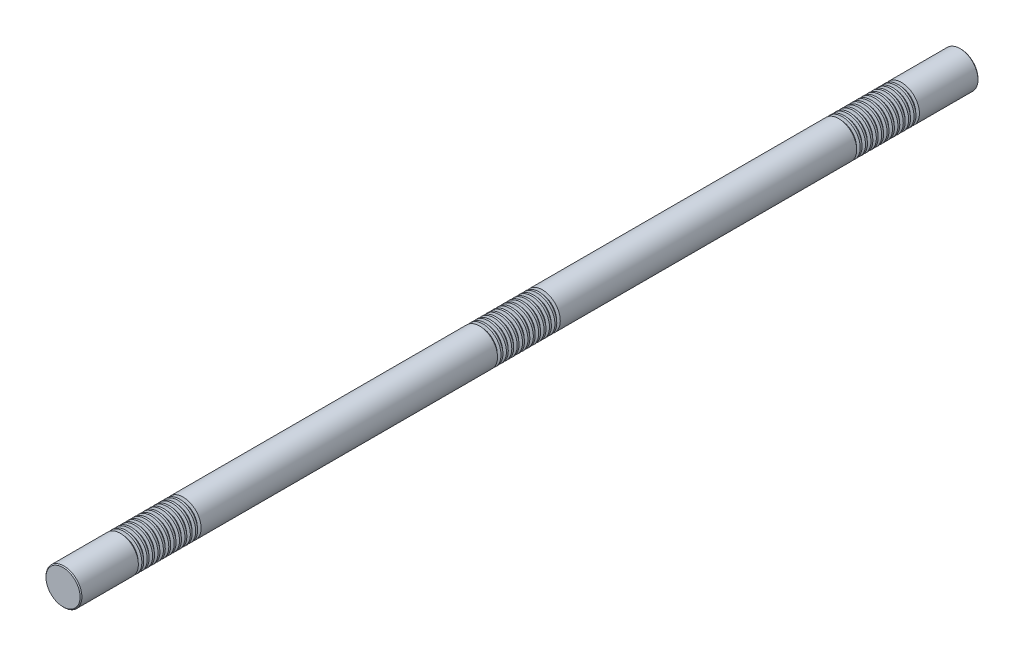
ISO-10303-21;
HEADER;
FILE_DESCRIPTION(('STEP AP214'),'2;1');
FILE_NAME('part.step','',(''),(''),'','','');
FILE_SCHEMA(('AUTOMOTIVE_DESIGN { 1 0 10303 214 1 1 1 1 }'));
ENDSEC;
DATA;
#1=APPLICATION_CONTEXT('core data for automotive mechanical design processes');
#2=APPLICATION_PROTOCOL_DEFINITION('international standard','automotive_design',2000,#1);
#3=PRODUCT_CONTEXT('',#1,'mechanical');
#4=PRODUCT('Part','Part','',(#3));
#5=PRODUCT_RELATED_PRODUCT_CATEGORY('part','',(#4));
#6=PRODUCT_DEFINITION_FORMATION('','',#4);
#7=PRODUCT_DEFINITION_CONTEXT('part definition',#1,'design');
#8=PRODUCT_DEFINITION('design','',#6,#7);
#9=PRODUCT_DEFINITION_SHAPE('','',#8);
#10=(LENGTH_UNIT() NAMED_UNIT(*) SI_UNIT(.MILLI.,.METRE.));
#11=(NAMED_UNIT(*) PLANE_ANGLE_UNIT() SI_UNIT($,.RADIAN.));
#12=(NAMED_UNIT(*) SI_UNIT($,.STERADIAN.) SOLID_ANGLE_UNIT());
#13=UNCERTAINTY_MEASURE_WITH_UNIT(LENGTH_MEASURE(1.E-05),#10,'distance_accuracy_value','');
#14=(GEOMETRIC_REPRESENTATION_CONTEXT(3) GLOBAL_UNCERTAINTY_ASSIGNED_CONTEXT((#13)) GLOBAL_UNIT_ASSIGNED_CONTEXT((#10,
#11,#12)) REPRESENTATION_CONTEXT('',''));
#15=CARTESIAN_POINT('',(0.,0.,0.));
#16=DIRECTION('',(0.,0.,1.));
#17=DIRECTION('',(1.,0.,0.));
#18=AXIS2_PLACEMENT_3D('',#15,#16,#17);
#19=CARTESIAN_POINT('',(0.,0.,750.));
#20=DIRECTION('',(0.,0.,-1.));
#21=DIRECTION('',(-1.,0.,0.));
#22=AXIS2_PLACEMENT_3D('',#19,#20,#21);
#23=CYLINDRICAL_SURFACE('',#22,30.);
#24=CARTESIAN_POINT('',(0.,0.,645.169872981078));
#25=DIRECTION('',(0.,0.,1.));
#26=DIRECTION('',(1.,0.,0.));
#27=AXIS2_PLACEMENT_3D('',#24,#25,#26);
#28=CIRCLE('',#27,30.);
#29=CARTESIAN_POINT('',(30.,0.,645.169872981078));
#30=VERTEX_POINT('',#29);
#31=EDGE_CURVE('E610',#30,#30,#28,.T.);
#32=ORIENTED_EDGE('',*,*,#31,.T.);
#33=EDGE_LOOP('',(#32));
#34=FACE_BOUND('',#33,.T.);
#35=CARTESIAN_POINT('',(0.,0.,648.330127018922));
#36=DIRECTION('',(0.,0.,1.));
#37=DIRECTION('',(1.,0.,0.));
#38=AXIS2_PLACEMENT_3D('',#35,#36,#37);
#39=CIRCLE('',#38,30.);
#40=CARTESIAN_POINT('',(30.,0.,648.330127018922));
#41=VERTEX_POINT('',#40);
#42=EDGE_CURVE('E621',#41,#41,#39,.T.);
#43=ORIENTED_EDGE('',*,*,#42,.F.);
#44=EDGE_LOOP('',(#43));
#45=FACE_BOUND('',#44,.T.);
#46=ADVANCED_FACE('F37',(#34,#45),#23,.T.);
#47=CARTESIAN_POINT('',(0.,0.,636.169872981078));
#48=DIRECTION('',(0.,0.,1.));
#49=DIRECTION('',(1.,0.,0.));
#50=AXIS2_PLACEMENT_3D('',#47,#48,#49);
#51=CIRCLE('',#50,30.);
#52=CARTESIAN_POINT('',(30.,0.,636.169872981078));
#53=VERTEX_POINT('',#52);
#54=EDGE_CURVE('E594',#53,#53,#51,.T.);
#55=ORIENTED_EDGE('',*,*,#54,.T.);
#56=EDGE_LOOP('',(#55));
#57=FACE_BOUND('',#56,.T.);
#58=CARTESIAN_POINT('',(0.,0.,639.330127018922));
#59=DIRECTION('',(0.,0.,1.));
#60=DIRECTION('',(1.,0.,0.));
#61=AXIS2_PLACEMENT_3D('',#58,#59,#60);
#62=CIRCLE('',#61,30.);
#63=CARTESIAN_POINT('',(30.,0.,639.330127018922));
#64=VERTEX_POINT('',#63);
#65=EDGE_CURVE('E606',#64,#64,#62,.T.);
#66=ORIENTED_EDGE('',*,*,#65,.F.);
#67=EDGE_LOOP('',(#66));
#68=FACE_BOUND('',#67,.T.);
#69=ADVANCED_FACE('F657',(#57,#68),#23,.T.);
#70=CARTESIAN_POINT('',(0.,0.,627.169872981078));
#71=DIRECTION('',(0.,0.,1.));
#72=DIRECTION('',(1.,0.,0.));
#73=AXIS2_PLACEMENT_3D('',#70,#71,#72);
#74=CIRCLE('',#73,30.);
#75=CARTESIAN_POINT('',(30.,0.,627.169872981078));
#76=VERTEX_POINT('',#75);
#77=EDGE_CURVE('E579',#76,#76,#74,.T.);
#78=ORIENTED_EDGE('',*,*,#77,.T.);
#79=EDGE_LOOP('',(#78));
#80=FACE_BOUND('',#79,.T.);
#81=CARTESIAN_POINT('',(0.,0.,630.330127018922));
#82=DIRECTION('',(0.,0.,1.));
#83=DIRECTION('',(1.,0.,0.));
#84=AXIS2_PLACEMENT_3D('',#81,#82,#83);
#85=CIRCLE('',#84,30.);
#86=CARTESIAN_POINT('',(30.,0.,630.330127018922));
#87=VERTEX_POINT('',#86);
#88=EDGE_CURVE('E591',#87,#87,#85,.T.);
#89=ORIENTED_EDGE('',*,*,#88,.F.);
#90=EDGE_LOOP('',(#89));
#91=FACE_BOUND('',#90,.T.);
#92=ADVANCED_FACE('F665',(#80,#91),#23,.T.);
#93=CARTESIAN_POINT('',(0.,0.,618.169872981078));
#94=DIRECTION('',(0.,0.,1.));
#95=DIRECTION('',(1.,0.,0.));
#96=AXIS2_PLACEMENT_3D('',#93,#94,#95);
#97=CIRCLE('',#96,30.);
#98=CARTESIAN_POINT('',(30.,0.,618.169872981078));
#99=VERTEX_POINT('',#98);
#100=EDGE_CURVE('E563',#99,#99,#97,.T.);
#101=ORIENTED_EDGE('',*,*,#100,.T.);
#102=EDGE_LOOP('',(#101));
#103=FACE_BOUND('',#102,.T.);
#104=CARTESIAN_POINT('',(0.,0.,621.330127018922));
#105=DIRECTION('',(0.,0.,1.));
#106=DIRECTION('',(1.,0.,0.));
#107=AXIS2_PLACEMENT_3D('',#104,#105,#106);
#108=CIRCLE('',#107,30.);
#109=CARTESIAN_POINT('',(30.,0.,621.330127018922));
#110=VERTEX_POINT('',#109);
#111=EDGE_CURVE('E575',#110,#110,#108,.T.);
#112=ORIENTED_EDGE('',*,*,#111,.F.);
#113=EDGE_LOOP('',(#112));
#114=FACE_BOUND('',#113,.T.);
#115=ADVANCED_FACE('F1396',(#103,#114),#23,.T.);
#116=CARTESIAN_POINT('',(0.,0.,609.169872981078));
#117=DIRECTION('',(0.,0.,1.));
#118=DIRECTION('',(1.,0.,0.));
#119=AXIS2_PLACEMENT_3D('',#116,#117,#118);
#120=CIRCLE('',#119,30.);
#121=CARTESIAN_POINT('',(30.,0.,609.169872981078));
#122=VERTEX_POINT('',#121);
#123=EDGE_CURVE('E547',#122,#122,#120,.T.);
#124=ORIENTED_EDGE('',*,*,#123,.T.);
#125=EDGE_LOOP('',(#124));
#126=FACE_BOUND('',#125,.T.);
#127=CARTESIAN_POINT('',(0.,0.,612.330127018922));
#128=DIRECTION('',(0.,0.,1.));
#129=DIRECTION('',(1.,0.,0.));
#130=AXIS2_PLACEMENT_3D('',#127,#128,#129);
#131=CIRCLE('',#130,30.);
#132=CARTESIAN_POINT('',(30.,0.,612.330127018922));
#133=VERTEX_POINT('',#132);
#134=EDGE_CURVE('E559',#133,#133,#131,.T.);
#135=ORIENTED_EDGE('',*,*,#134,.F.);
#136=EDGE_LOOP('',(#135));
#137=FACE_BOUND('',#136,.T.);
#138=ADVANCED_FACE('F1373',(#126,#137),#23,.T.);
#139=CARTESIAN_POINT('',(0.,0.,600.169872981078));
#140=DIRECTION('',(0.,0.,1.));
#141=DIRECTION('',(1.,0.,0.));
#142=AXIS2_PLACEMENT_3D('',#139,#140,#141);
#143=CIRCLE('',#142,30.);
#144=CARTESIAN_POINT('',(30.,0.,600.169872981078));
#145=VERTEX_POINT('',#144);
#146=EDGE_CURVE('E531',#145,#145,#143,.T.);
#147=ORIENTED_EDGE('',*,*,#146,.T.);
#148=EDGE_LOOP('',(#147));
#149=FACE_BOUND('',#148,.T.);
#150=CARTESIAN_POINT('',(0.,0.,603.330127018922));
#151=DIRECTION('',(0.,0.,1.));
#152=DIRECTION('',(1.,0.,0.));
#153=AXIS2_PLACEMENT_3D('',#150,#151,#152);
#154=CIRCLE('',#153,30.);
#155=CARTESIAN_POINT('',(30.,0.,603.330127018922));
#156=VERTEX_POINT('',#155);
#157=EDGE_CURVE('E543',#156,#156,#154,.T.);
#158=ORIENTED_EDGE('',*,*,#157,.F.);
#159=EDGE_LOOP('',(#158));
#160=FACE_BOUND('',#159,.T.);
#161=ADVANCED_FACE('F1350',(#149,#160),#23,.T.);
#162=CARTESIAN_POINT('',(0.,0.,591.169872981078));
#163=DIRECTION('',(0.,0.,1.));
#164=DIRECTION('',(1.,0.,0.));
#165=AXIS2_PLACEMENT_3D('',#162,#163,#164);
#166=CIRCLE('',#165,30.);
#167=CARTESIAN_POINT('',(30.,0.,591.169872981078));
#168=VERTEX_POINT('',#167);
#169=EDGE_CURVE('E515',#168,#168,#166,.T.);
#170=ORIENTED_EDGE('',*,*,#169,.T.);
#171=EDGE_LOOP('',(#170));
#172=FACE_BOUND('',#171,.T.);
#173=CARTESIAN_POINT('',(0.,0.,594.330127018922));
#174=DIRECTION('',(0.,0.,1.));
#175=DIRECTION('',(1.,0.,0.));
#176=AXIS2_PLACEMENT_3D('',#173,#174,#175);
#177=CIRCLE('',#176,30.);
#178=CARTESIAN_POINT('',(30.,0.,594.330127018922));
#179=VERTEX_POINT('',#178);
#180=EDGE_CURVE('E527',#179,#179,#177,.T.);
#181=ORIENTED_EDGE('',*,*,#180,.F.);
#182=EDGE_LOOP('',(#181));
#183=FACE_BOUND('',#182,.T.);
#184=ADVANCED_FACE('F1327',(#172,#183),#23,.T.);
#185=CARTESIAN_POINT('',(0.,0.,582.169872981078));
#186=DIRECTION('',(0.,0.,1.));
#187=DIRECTION('',(1.,0.,0.));
#188=AXIS2_PLACEMENT_3D('',#185,#186,#187);
#189=CIRCLE('',#188,30.);
#190=CARTESIAN_POINT('',(30.,0.,582.169872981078));
#191=VERTEX_POINT('',#190);
#192=EDGE_CURVE('E499',#191,#191,#189,.T.);
#193=ORIENTED_EDGE('',*,*,#192,.T.);
#194=EDGE_LOOP('',(#193));
#195=FACE_BOUND('',#194,.T.);
#196=CARTESIAN_POINT('',(0.,0.,585.330127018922));
#197=DIRECTION('',(0.,0.,1.));
#198=DIRECTION('',(1.,0.,0.));
#199=AXIS2_PLACEMENT_3D('',#196,#197,#198);
#200=CIRCLE('',#199,30.);
#201=CARTESIAN_POINT('',(30.,0.,585.330127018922));
#202=VERTEX_POINT('',#201);
#203=EDGE_CURVE('E511',#202,#202,#200,.T.);
#204=ORIENTED_EDGE('',*,*,#203,.F.);
#205=EDGE_LOOP('',(#204));
#206=FACE_BOUND('',#205,.T.);
#207=ADVANCED_FACE('F1304',(#195,#206),#23,.T.);
#208=CARTESIAN_POINT('',(0.,0.,573.169872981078));
#209=DIRECTION('',(0.,0.,1.));
#210=DIRECTION('',(1.,0.,0.));
#211=AXIS2_PLACEMENT_3D('',#208,#209,#210);
#212=CIRCLE('',#211,30.);
#213=CARTESIAN_POINT('',(30.,0.,573.169872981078));
#214=VERTEX_POINT('',#213);
#215=EDGE_CURVE('E483',#214,#214,#212,.T.);
#216=ORIENTED_EDGE('',*,*,#215,.T.);
#217=EDGE_LOOP('',(#216));
#218=FACE_BOUND('',#217,.T.);
#219=CARTESIAN_POINT('',(0.,0.,576.330127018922));
#220=DIRECTION('',(0.,0.,1.));
#221=DIRECTION('',(1.,0.,0.));
#222=AXIS2_PLACEMENT_3D('',#219,#220,#221);
#223=CIRCLE('',#222,30.);
#224=CARTESIAN_POINT('',(30.,0.,576.330127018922));
#225=VERTEX_POINT('',#224);
#226=EDGE_CURVE('E495',#225,#225,#223,.T.);
#227=ORIENTED_EDGE('',*,*,#226,.F.);
#228=EDGE_LOOP('',(#227));
#229=FACE_BOUND('',#228,.T.);
#230=ADVANCED_FACE('F1281',(#218,#229),#23,.T.);
#231=CARTESIAN_POINT('',(0.,0.,564.169872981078));
#232=DIRECTION('',(0.,0.,1.));
#233=DIRECTION('',(1.,0.,0.));
#234=AXIS2_PLACEMENT_3D('',#231,#232,#233);
#235=CIRCLE('',#234,30.);
#236=CARTESIAN_POINT('',(30.,0.,564.169872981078));
#237=VERTEX_POINT('',#236);
#238=EDGE_CURVE('E467',#237,#237,#235,.T.);
#239=ORIENTED_EDGE('',*,*,#238,.T.);
#240=EDGE_LOOP('',(#239));
#241=FACE_BOUND('',#240,.T.);
#242=CARTESIAN_POINT('',(0.,0.,567.330127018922));
#243=DIRECTION('',(0.,0.,1.));
#244=DIRECTION('',(1.,0.,0.));
#245=AXIS2_PLACEMENT_3D('',#242,#243,#244);
#246=CIRCLE('',#245,30.);
#247=CARTESIAN_POINT('',(30.,0.,567.330127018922));
#248=VERTEX_POINT('',#247);
#249=EDGE_CURVE('E479',#248,#248,#246,.T.);
#250=ORIENTED_EDGE('',*,*,#249,.F.);
#251=EDGE_LOOP('',(#250));
#252=FACE_BOUND('',#251,.T.);
#253=ADVANCED_FACE('F1262',(#241,#252),#23,.T.);
#254=CARTESIAN_POINT('',(0.,0.,555.169872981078));
#255=DIRECTION('',(0.,0.,1.));
#256=DIRECTION('',(1.,0.,0.));
#257=AXIS2_PLACEMENT_3D('',#254,#255,#256);
#258=CIRCLE('',#257,30.);
#259=CARTESIAN_POINT('',(30.,0.,555.169872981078));
#260=VERTEX_POINT('',#259);
#261=EDGE_CURVE('E275',#260,#260,#258,.T.);
#262=ORIENTED_EDGE('',*,*,#261,.T.);
#263=EDGE_LOOP('',(#262));
#264=FACE_BOUND('',#263,.T.);
#265=CARTESIAN_POINT('',(0.,0.,558.330127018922));
#266=DIRECTION('',(0.,0.,1.));
#267=DIRECTION('',(1.,0.,0.));
#268=AXIS2_PLACEMENT_3D('',#265,#266,#267);
#269=CIRCLE('',#268,30.);
#270=CARTESIAN_POINT('',(30.,0.,558.330127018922));
#271=VERTEX_POINT('',#270);
#272=EDGE_CURVE('E463',#271,#271,#269,.T.);
#273=ORIENTED_EDGE('',*,*,#272,.F.);
#274=EDGE_LOOP('',(#273));
#275=FACE_BOUND('',#274,.T.);
#276=ADVANCED_FACE('F1211',(#264,#275),#23,.T.);
#277=CARTESIAN_POINT('',(0.,0.,45.1698729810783));
#278=DIRECTION('',(0.,0.,1.));
#279=DIRECTION('',(1.,0.,0.));
#280=AXIS2_PLACEMENT_3D('',#277,#278,#279);
#281=CIRCLE('',#280,30.);
#282=CARTESIAN_POINT('',(30.,0.,45.1698729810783));
#283=VERTEX_POINT('',#282);
#284=EDGE_CURVE('E435',#283,#283,#281,.T.);
#285=ORIENTED_EDGE('',*,*,#284,.T.);
#286=EDGE_LOOP('',(#285));
#287=FACE_BOUND('',#286,.T.);
#288=CARTESIAN_POINT('',(0.,0.,48.3301270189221));
#289=DIRECTION('',(0.,0.,1.));
#290=DIRECTION('',(1.,0.,0.));
#291=AXIS2_PLACEMENT_3D('',#288,#289,#290);
#292=CIRCLE('',#291,30.);
#293=CARTESIAN_POINT('',(30.,0.,48.3301270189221));
#294=VERTEX_POINT('',#293);
#295=EDGE_CURVE('E447',#294,#294,#292,.T.);
#296=ORIENTED_EDGE('',*,*,#295,.F.);
#297=EDGE_LOOP('',(#296));
#298=FACE_BOUND('',#297,.T.);
#299=ADVANCED_FACE('F1187',(#287,#298),#23,.T.);
#300=CARTESIAN_POINT('',(0.,0.,36.1698729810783));
#301=DIRECTION('',(0.,0.,1.));
#302=DIRECTION('',(1.,0.,0.));
#303=AXIS2_PLACEMENT_3D('',#300,#301,#302);
#304=CIRCLE('',#303,30.);
#305=CARTESIAN_POINT('',(30.,0.,36.1698729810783));
#306=VERTEX_POINT('',#305);
#307=EDGE_CURVE('E419',#306,#306,#304,.T.);
#308=ORIENTED_EDGE('',*,*,#307,.T.);
#309=EDGE_LOOP('',(#308));
#310=FACE_BOUND('',#309,.T.);
#311=CARTESIAN_POINT('',(0.,0.,39.3301270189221));
#312=DIRECTION('',(0.,0.,1.));
#313=DIRECTION('',(1.,0.,0.));
#314=AXIS2_PLACEMENT_3D('',#311,#312,#313);
#315=CIRCLE('',#314,30.);
#316=CARTESIAN_POINT('',(30.,0.,39.3301270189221));
#317=VERTEX_POINT('',#316);
#318=EDGE_CURVE('E431',#317,#317,#315,.T.);
#319=ORIENTED_EDGE('',*,*,#318,.F.);
#320=EDGE_LOOP('',(#319));
#321=FACE_BOUND('',#320,.T.);
#322=ADVANCED_FACE('F1164',(#310,#321),#23,.T.);
#323=CARTESIAN_POINT('',(0.,0.,27.1698729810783));
#324=DIRECTION('',(0.,0.,1.));
#325=DIRECTION('',(1.,0.,0.));
#326=AXIS2_PLACEMENT_3D('',#323,#324,#325);
#327=CIRCLE('',#326,30.);
#328=CARTESIAN_POINT('',(30.,0.,27.1698729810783));
#329=VERTEX_POINT('',#328);
#330=EDGE_CURVE('E403',#329,#329,#327,.T.);
#331=ORIENTED_EDGE('',*,*,#330,.T.);
#332=EDGE_LOOP('',(#331));
#333=FACE_BOUND('',#332,.T.);
#334=CARTESIAN_POINT('',(0.,0.,30.3301270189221));
#335=DIRECTION('',(0.,0.,1.));
#336=DIRECTION('',(1.,0.,0.));
#337=AXIS2_PLACEMENT_3D('',#334,#335,#336);
#338=CIRCLE('',#337,30.);
#339=CARTESIAN_POINT('',(30.,0.,30.3301270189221));
#340=VERTEX_POINT('',#339);
#341=EDGE_CURVE('E415',#340,#340,#338,.T.);
#342=ORIENTED_EDGE('',*,*,#341,.F.);
#343=EDGE_LOOP('',(#342));
#344=FACE_BOUND('',#343,.T.);
#345=ADVANCED_FACE('F1141',(#333,#344),#23,.T.);
#346=CARTESIAN_POINT('',(0.,0.,18.1698729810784));
#347=DIRECTION('',(0.,0.,1.));
#348=DIRECTION('',(1.,0.,0.));
#349=AXIS2_PLACEMENT_3D('',#346,#347,#348);
#350=CIRCLE('',#349,30.);
#351=CARTESIAN_POINT('',(30.,0.,18.1698729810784));
#352=VERTEX_POINT('',#351);
#353=EDGE_CURVE('E387',#352,#352,#350,.T.);
#354=ORIENTED_EDGE('',*,*,#353,.T.);
#355=EDGE_LOOP('',(#354));
#356=FACE_BOUND('',#355,.T.);
#357=CARTESIAN_POINT('',(0.,0.,21.3301270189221));
#358=DIRECTION('',(0.,0.,1.));
#359=DIRECTION('',(1.,0.,0.));
#360=AXIS2_PLACEMENT_3D('',#357,#358,#359);
#361=CIRCLE('',#360,30.);
#362=CARTESIAN_POINT('',(30.,0.,21.3301270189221));
#363=VERTEX_POINT('',#362);
#364=EDGE_CURVE('E399',#363,#363,#361,.T.);
#365=ORIENTED_EDGE('',*,*,#364,.F.);
#366=EDGE_LOOP('',(#365));
#367=FACE_BOUND('',#366,.T.);
#368=ADVANCED_FACE('F1118',(#356,#367),#23,.T.);
#369=CARTESIAN_POINT('',(0.,0.,9.1698729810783));
#370=DIRECTION('',(0.,0.,1.));
#371=DIRECTION('',(1.,0.,0.));
#372=AXIS2_PLACEMENT_3D('',#369,#370,#371);
#373=CIRCLE('',#372,30.);
#374=CARTESIAN_POINT('',(30.,0.,9.1698729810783));
#375=VERTEX_POINT('',#374);
#376=EDGE_CURVE('E371',#375,#375,#373,.T.);
#377=ORIENTED_EDGE('',*,*,#376,.T.);
#378=EDGE_LOOP('',(#377));
#379=FACE_BOUND('',#378,.T.);
#380=CARTESIAN_POINT('',(0.,0.,12.3301270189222));
#381=DIRECTION('',(0.,0.,1.));
#382=DIRECTION('',(1.,0.,0.));
#383=AXIS2_PLACEMENT_3D('',#380,#381,#382);
#384=CIRCLE('',#383,30.);
#385=CARTESIAN_POINT('',(30.,0.,12.3301270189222));
#386=VERTEX_POINT('',#385);
#387=EDGE_CURVE('E383',#386,#386,#384,.T.);
#388=ORIENTED_EDGE('',*,*,#387,.F.);
#389=EDGE_LOOP('',(#388));
#390=FACE_BOUND('',#389,.T.);
#391=ADVANCED_FACE('F1095',(#379,#390),#23,.T.);
#392=CARTESIAN_POINT('',(0.,0.,0.169872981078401));
#393=DIRECTION('',(0.,0.,1.));
#394=DIRECTION('',(1.,0.,0.));
#395=AXIS2_PLACEMENT_3D('',#392,#393,#394);
#396=CIRCLE('',#395,30.);
#397=CARTESIAN_POINT('',(30.,0.,0.169872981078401));
#398=VERTEX_POINT('',#397);
#399=EDGE_CURVE('E355',#398,#398,#396,.T.);
#400=ORIENTED_EDGE('',*,*,#399,.T.);
#401=EDGE_LOOP('',(#400));
#402=FACE_BOUND('',#401,.T.);
#403=CARTESIAN_POINT('',(0.,0.,3.3301270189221));
#404=DIRECTION('',(0.,0.,1.));
#405=DIRECTION('',(1.,0.,0.));
#406=AXIS2_PLACEMENT_3D('',#403,#404,#405);
#407=CIRCLE('',#406,30.);
#408=CARTESIAN_POINT('',(30.,0.,3.3301270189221));
#409=VERTEX_POINT('',#408);
#410=EDGE_CURVE('E367',#409,#409,#407,.T.);
#411=ORIENTED_EDGE('',*,*,#410,.F.);
#412=EDGE_LOOP('',(#411));
#413=FACE_BOUND('',#412,.T.);
#414=ADVANCED_FACE('F1072',(#402,#413),#23,.T.);
#415=CARTESIAN_POINT('',(0.,0.,-8.83012701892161));
#416=DIRECTION('',(0.,0.,1.));
#417=DIRECTION('',(1.,0.,0.));
#418=AXIS2_PLACEMENT_3D('',#415,#416,#417);
#419=CIRCLE('',#418,30.);
#420=CARTESIAN_POINT('',(30.,0.,-8.83012701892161));
#421=VERTEX_POINT('',#420);
#422=EDGE_CURVE('E339',#421,#421,#419,.T.);
#423=ORIENTED_EDGE('',*,*,#422,.T.);
#424=EDGE_LOOP('',(#423));
#425=FACE_BOUND('',#424,.T.);
#426=CARTESIAN_POINT('',(0.,0.,-5.66987298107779));
#427=DIRECTION('',(0.,0.,1.));
#428=DIRECTION('',(1.,0.,0.));
#429=AXIS2_PLACEMENT_3D('',#426,#427,#428);
#430=CIRCLE('',#429,30.);
#431=CARTESIAN_POINT('',(30.,0.,-5.66987298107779));
#432=VERTEX_POINT('',#431);
#433=EDGE_CURVE('E351',#432,#432,#430,.T.);
#434=ORIENTED_EDGE('',*,*,#433,.F.);
#435=EDGE_LOOP('',(#434));
#436=FACE_BOUND('',#435,.T.);
#437=ADVANCED_FACE('F1049',(#425,#436),#23,.T.);
#438=CARTESIAN_POINT('',(0.,0.,-17.8301270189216));
#439=DIRECTION('',(0.,0.,1.));
#440=DIRECTION('',(1.,0.,0.));
#441=AXIS2_PLACEMENT_3D('',#438,#439,#440);
#442=CIRCLE('',#441,30.);
#443=CARTESIAN_POINT('',(30.,0.,-17.8301270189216));
#444=VERTEX_POINT('',#443);
#445=EDGE_CURVE('E323',#444,#444,#442,.T.);
#446=ORIENTED_EDGE('',*,*,#445,.T.);
#447=EDGE_LOOP('',(#446));
#448=FACE_BOUND('',#447,.T.);
#449=CARTESIAN_POINT('',(0.,0.,-14.6698729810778));
#450=DIRECTION('',(0.,0.,1.));
#451=DIRECTION('',(1.,0.,0.));
#452=AXIS2_PLACEMENT_3D('',#449,#450,#451);
#453=CIRCLE('',#452,30.);
#454=CARTESIAN_POINT('',(30.,0.,-14.6698729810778));
#455=VERTEX_POINT('',#454);
#456=EDGE_CURVE('E335',#455,#455,#453,.T.);
#457=ORIENTED_EDGE('',*,*,#456,.F.);
#458=EDGE_LOOP('',(#457));
#459=FACE_BOUND('',#458,.T.);
#460=ADVANCED_FACE('F1026',(#448,#459),#23,.T.);
#461=CARTESIAN_POINT('',(0.,0.,-26.8301270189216));
#462=DIRECTION('',(0.,0.,1.));
#463=DIRECTION('',(1.,0.,0.));
#464=AXIS2_PLACEMENT_3D('',#461,#462,#463);
#465=CIRCLE('',#464,30.);
#466=CARTESIAN_POINT('',(30.,0.,-26.8301270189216));
#467=VERTEX_POINT('',#466);
#468=EDGE_CURVE('E307',#467,#467,#465,.T.);
#469=ORIENTED_EDGE('',*,*,#468,.T.);
#470=EDGE_LOOP('',(#469));
#471=FACE_BOUND('',#470,.T.);
#472=CARTESIAN_POINT('',(0.,0.,-23.6698729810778));
#473=DIRECTION('',(0.,0.,1.));
#474=DIRECTION('',(1.,0.,0.));
#475=AXIS2_PLACEMENT_3D('',#472,#473,#474);
#476=CIRCLE('',#475,30.);
#477=CARTESIAN_POINT('',(30.,0.,-23.6698729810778));
#478=VERTEX_POINT('',#477);
#479=EDGE_CURVE('E319',#478,#478,#476,.T.);
#480=ORIENTED_EDGE('',*,*,#479,.F.);
#481=EDGE_LOOP('',(#480));
#482=FACE_BOUND('',#481,.T.);
#483=ADVANCED_FACE('F1003',(#471,#482),#23,.T.);
#484=CARTESIAN_POINT('',(0.,0.,-35.8301270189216));
#485=DIRECTION('',(0.,0.,1.));
#486=DIRECTION('',(1.,0.,0.));
#487=AXIS2_PLACEMENT_3D('',#484,#485,#486);
#488=CIRCLE('',#487,30.);
#489=CARTESIAN_POINT('',(30.,0.,-35.8301270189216));
#490=VERTEX_POINT('',#489);
#491=EDGE_CURVE('E291',#490,#490,#488,.T.);
#492=ORIENTED_EDGE('',*,*,#491,.T.);
#493=EDGE_LOOP('',(#492));
#494=FACE_BOUND('',#493,.T.);
#495=CARTESIAN_POINT('',(0.,0.,-32.6698729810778));
#496=DIRECTION('',(0.,0.,1.));
#497=DIRECTION('',(1.,0.,0.));
#498=AXIS2_PLACEMENT_3D('',#495,#496,#497);
#499=CIRCLE('',#498,30.);
#500=CARTESIAN_POINT('',(30.,0.,-32.6698729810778));
#501=VERTEX_POINT('',#500);
#502=EDGE_CURVE('E303',#501,#501,#499,.T.);
#503=ORIENTED_EDGE('',*,*,#502,.F.);
#504=EDGE_LOOP('',(#503));
#505=FACE_BOUND('',#504,.T.);
#506=ADVANCED_FACE('F980',(#494,#505),#23,.T.);
#507=CARTESIAN_POINT('',(0.,0.,-44.8301270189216));
#508=DIRECTION('',(0.,0.,1.));
#509=DIRECTION('',(1.,0.,0.));
#510=AXIS2_PLACEMENT_3D('',#507,#508,#509);
#511=CIRCLE('',#510,30.);
#512=CARTESIAN_POINT('',(30.,0.,-44.8301270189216));
#513=VERTEX_POINT('',#512);
#514=EDGE_CURVE('E259',#513,#513,#511,.T.);
#515=ORIENTED_EDGE('',*,*,#514,.T.);
#516=EDGE_LOOP('',(#515));
#517=FACE_BOUND('',#516,.T.);
#518=CARTESIAN_POINT('',(0.,0.,-41.6698729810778));
#519=DIRECTION('',(0.,0.,1.));
#520=DIRECTION('',(1.,0.,0.));
#521=AXIS2_PLACEMENT_3D('',#518,#519,#520);
#522=CIRCLE('',#521,30.);
#523=CARTESIAN_POINT('',(30.,0.,-41.6698729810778));
#524=VERTEX_POINT('',#523);
#525=EDGE_CURVE('E287',#524,#524,#522,.T.);
#526=ORIENTED_EDGE('',*,*,#525,.F.);
#527=EDGE_LOOP('',(#526));
#528=FACE_BOUND('',#527,.T.);
#529=ADVANCED_FACE('F957',(#517,#528),#23,.T.);
#530=CARTESIAN_POINT('',(0.,0.,-545.830127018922));
#531=DIRECTION('',(0.,0.,1.));
#532=DIRECTION('',(1.,0.,0.));
#533=AXIS2_PLACEMENT_3D('',#530,#531,#532);
#534=CIRCLE('',#533,30.);
#535=CARTESIAN_POINT('',(30.,0.,-545.830127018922));
#536=VERTEX_POINT('',#535);
#537=EDGE_CURVE('E243',#536,#536,#534,.T.);
#538=ORIENTED_EDGE('',*,*,#537,.T.);
#539=EDGE_LOOP('',(#538));
#540=FACE_BOUND('',#539,.T.);
#541=CARTESIAN_POINT('',(0.,0.,-50.6698729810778));
#542=DIRECTION('',(0.,0.,1.));
#543=DIRECTION('',(1.,0.,0.));
#544=AXIS2_PLACEMENT_3D('',#541,#542,#543);
#545=CIRCLE('',#544,30.);
#546=CARTESIAN_POINT('',(30.,0.,-50.6698729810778));
#547=VERTEX_POINT('',#546);
#548=EDGE_CURVE('E255',#547,#547,#545,.T.);
#549=ORIENTED_EDGE('',*,*,#548,.F.);
#550=EDGE_LOOP('',(#549));
#551=FACE_BOUND('',#550,.T.);
#552=ADVANCED_FACE('F934',(#540,#551),#23,.T.);
#553=CARTESIAN_POINT('',(0.,0.,-554.830127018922));
#554=DIRECTION('',(0.,0.,1.));
#555=DIRECTION('',(1.,0.,0.));
#556=AXIS2_PLACEMENT_3D('',#553,#554,#555);
#557=CIRCLE('',#556,30.);
#558=CARTESIAN_POINT('',(30.,0.,-554.830127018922));
#559=VERTEX_POINT('',#558);
#560=EDGE_CURVE('E227',#559,#559,#557,.T.);
#561=ORIENTED_EDGE('',*,*,#560,.T.);
#562=EDGE_LOOP('',(#561));
#563=FACE_BOUND('',#562,.T.);
#564=CARTESIAN_POINT('',(0.,0.,-551.669872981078));
#565=DIRECTION('',(0.,0.,1.));
#566=DIRECTION('',(1.,0.,0.));
#567=AXIS2_PLACEMENT_3D('',#564,#565,#566);
#568=CIRCLE('',#567,30.);
#569=CARTESIAN_POINT('',(30.,0.,-551.669872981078));
#570=VERTEX_POINT('',#569);
#571=EDGE_CURVE('E239',#570,#570,#568,.T.);
#572=ORIENTED_EDGE('',*,*,#571,.F.);
#573=EDGE_LOOP('',(#572));
#574=FACE_BOUND('',#573,.T.);
#575=ADVANCED_FACE('F911',(#563,#574),#23,.T.);
#576=CARTESIAN_POINT('',(0.,0.,-563.830127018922));
#577=DIRECTION('',(0.,0.,1.));
#578=DIRECTION('',(1.,0.,0.));
#579=AXIS2_PLACEMENT_3D('',#576,#577,#578);
#580=CIRCLE('',#579,30.);
#581=CARTESIAN_POINT('',(30.,0.,-563.830127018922));
#582=VERTEX_POINT('',#581);
#583=EDGE_CURVE('E211',#582,#582,#580,.T.);
#584=ORIENTED_EDGE('',*,*,#583,.T.);
#585=EDGE_LOOP('',(#584));
#586=FACE_BOUND('',#585,.T.);
#587=CARTESIAN_POINT('',(0.,0.,-560.669872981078));
#588=DIRECTION('',(0.,0.,1.));
#589=DIRECTION('',(1.,0.,0.));
#590=AXIS2_PLACEMENT_3D('',#587,#588,#589);
#591=CIRCLE('',#590,30.);
#592=CARTESIAN_POINT('',(30.,0.,-560.669872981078));
#593=VERTEX_POINT('',#592);
#594=EDGE_CURVE('E223',#593,#593,#591,.T.);
#595=ORIENTED_EDGE('',*,*,#594,.F.);
#596=EDGE_LOOP('',(#595));
#597=FACE_BOUND('',#596,.T.);
#598=ADVANCED_FACE('F888',(#586,#597),#23,.T.);
#599=CARTESIAN_POINT('',(0.,0.,-572.830127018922));
#600=DIRECTION('',(0.,0.,1.));
#601=DIRECTION('',(1.,0.,0.));
#602=AXIS2_PLACEMENT_3D('',#599,#600,#601);
#603=CIRCLE('',#602,30.);
#604=CARTESIAN_POINT('',(30.,0.,-572.830127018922));
#605=VERTEX_POINT('',#604);
#606=EDGE_CURVE('E195',#605,#605,#603,.T.);
#607=ORIENTED_EDGE('',*,*,#606,.T.);
#608=EDGE_LOOP('',(#607));
#609=FACE_BOUND('',#608,.T.);
#610=CARTESIAN_POINT('',(0.,0.,-569.669872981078));
#611=DIRECTION('',(0.,0.,1.));
#612=DIRECTION('',(1.,0.,0.));
#613=AXIS2_PLACEMENT_3D('',#610,#611,#612);
#614=CIRCLE('',#613,30.);
#615=CARTESIAN_POINT('',(30.,0.,-569.669872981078));
#616=VERTEX_POINT('',#615);
#617=EDGE_CURVE('E207',#616,#616,#614,.T.);
#618=ORIENTED_EDGE('',*,*,#617,.F.);
#619=EDGE_LOOP('',(#618));
#620=FACE_BOUND('',#619,.T.);
#621=ADVANCED_FACE('F865',(#609,#620),#23,.T.);
#622=CARTESIAN_POINT('',(0.,0.,-581.830127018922));
#623=DIRECTION('',(0.,0.,1.));
#624=DIRECTION('',(1.,0.,0.));
#625=AXIS2_PLACEMENT_3D('',#622,#623,#624);
#626=CIRCLE('',#625,30.);
#627=CARTESIAN_POINT('',(30.,0.,-581.830127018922));
#628=VERTEX_POINT('',#627);
#629=EDGE_CURVE('E179',#628,#628,#626,.T.);
#630=ORIENTED_EDGE('',*,*,#629,.T.);
#631=EDGE_LOOP('',(#630));
#632=FACE_BOUND('',#631,.T.);
#633=CARTESIAN_POINT('',(0.,0.,-578.669872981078));
#634=DIRECTION('',(0.,0.,1.));
#635=DIRECTION('',(1.,0.,0.));
#636=AXIS2_PLACEMENT_3D('',#633,#634,#635);
#637=CIRCLE('',#636,30.);
#638=CARTESIAN_POINT('',(30.,0.,-578.669872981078));
#639=VERTEX_POINT('',#638);
#640=EDGE_CURVE('E191',#639,#639,#637,.T.);
#641=ORIENTED_EDGE('',*,*,#640,.F.);
#642=EDGE_LOOP('',(#641));
#643=FACE_BOUND('',#642,.T.);
#644=ADVANCED_FACE('F842',(#632,#643),#23,.T.);
#645=CARTESIAN_POINT('',(0.,0.,-590.830127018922));
#646=DIRECTION('',(0.,0.,1.));
#647=DIRECTION('',(1.,0.,0.));
#648=AXIS2_PLACEMENT_3D('',#645,#646,#647);
#649=CIRCLE('',#648,30.);
#650=CARTESIAN_POINT('',(30.,0.,-590.830127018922));
#651=VERTEX_POINT('',#650);
#652=EDGE_CURVE('E163',#651,#651,#649,.T.);
#653=ORIENTED_EDGE('',*,*,#652,.T.);
#654=EDGE_LOOP('',(#653));
#655=FACE_BOUND('',#654,.T.);
#656=CARTESIAN_POINT('',(0.,0.,-587.669872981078));
#657=DIRECTION('',(0.,0.,1.));
#658=DIRECTION('',(1.,0.,0.));
#659=AXIS2_PLACEMENT_3D('',#656,#657,#658);
#660=CIRCLE('',#659,30.);
#661=CARTESIAN_POINT('',(30.,0.,-587.669872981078));
#662=VERTEX_POINT('',#661);
#663=EDGE_CURVE('E175',#662,#662,#660,.T.);
#664=ORIENTED_EDGE('',*,*,#663,.F.);
#665=EDGE_LOOP('',(#664));
#666=FACE_BOUND('',#665,.T.);
#667=ADVANCED_FACE('F819',(#655,#666),#23,.T.);
#668=CARTESIAN_POINT('',(0.,0.,-599.830127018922));
#669=DIRECTION('',(0.,0.,1.));
#670=DIRECTION('',(1.,0.,0.));
#671=AXIS2_PLACEMENT_3D('',#668,#669,#670);
#672=CIRCLE('',#671,30.);
#673=CARTESIAN_POINT('',(30.,0.,-599.830127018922));
#674=VERTEX_POINT('',#673);
#675=EDGE_CURVE('E147',#674,#674,#672,.T.);
#676=ORIENTED_EDGE('',*,*,#675,.T.);
#677=EDGE_LOOP('',(#676));
#678=FACE_BOUND('',#677,.T.);
#679=CARTESIAN_POINT('',(0.,0.,-596.669872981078));
#680=DIRECTION('',(0.,0.,1.));
#681=DIRECTION('',(1.,0.,0.));
#682=AXIS2_PLACEMENT_3D('',#679,#680,#681);
#683=CIRCLE('',#682,30.);
#684=CARTESIAN_POINT('',(30.,0.,-596.669872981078));
#685=VERTEX_POINT('',#684);
#686=EDGE_CURVE('E159',#685,#685,#683,.T.);
#687=ORIENTED_EDGE('',*,*,#686,.F.);
#688=EDGE_LOOP('',(#687));
#689=FACE_BOUND('',#688,.T.);
#690=ADVANCED_FACE('F796',(#678,#689),#23,.T.);
#691=CARTESIAN_POINT('',(0.,0.,-608.830127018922));
#692=DIRECTION('',(0.,0.,1.));
#693=DIRECTION('',(1.,0.,0.));
#694=AXIS2_PLACEMENT_3D('',#691,#692,#693);
#695=CIRCLE('',#694,30.);
#696=CARTESIAN_POINT('',(30.,0.,-608.830127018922));
#697=VERTEX_POINT('',#696);
#698=EDGE_CURVE('E131',#697,#697,#695,.T.);
#699=ORIENTED_EDGE('',*,*,#698,.T.);
#700=EDGE_LOOP('',(#699));
#701=FACE_BOUND('',#700,.T.);
#702=CARTESIAN_POINT('',(0.,0.,-605.669872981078));
#703=DIRECTION('',(0.,0.,1.));
#704=DIRECTION('',(1.,0.,0.));
#705=AXIS2_PLACEMENT_3D('',#702,#703,#704);
#706=CIRCLE('',#705,30.);
#707=CARTESIAN_POINT('',(30.,0.,-605.669872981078));
#708=VERTEX_POINT('',#707);
#709=EDGE_CURVE('E143',#708,#708,#706,.T.);
#710=ORIENTED_EDGE('',*,*,#709,.F.);
#711=EDGE_LOOP('',(#710));
#712=FACE_BOUND('',#711,.T.);
#713=ADVANCED_FACE('F773',(#701,#712),#23,.T.);
#714=CARTESIAN_POINT('',(0.,0.,-617.830127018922));
#715=DIRECTION('',(0.,0.,1.));
#716=DIRECTION('',(1.,0.,0.));
#717=AXIS2_PLACEMENT_3D('',#714,#715,#716);
#718=CIRCLE('',#717,30.);
#719=CARTESIAN_POINT('',(30.,0.,-617.830127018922));
#720=VERTEX_POINT('',#719);
#721=EDGE_CURVE('E116',#720,#720,#718,.T.);
#722=ORIENTED_EDGE('',*,*,#721,.T.);
#723=EDGE_LOOP('',(#722));
#724=FACE_BOUND('',#723,.T.);
#725=CARTESIAN_POINT('',(0.,0.,-614.669872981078));
#726=DIRECTION('',(0.,0.,1.));
#727=DIRECTION('',(1.,0.,0.));
#728=AXIS2_PLACEMENT_3D('',#725,#726,#727);
#729=CIRCLE('',#728,30.);
#730=CARTESIAN_POINT('',(30.,0.,-614.669872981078));
#731=VERTEX_POINT('',#730);
#732=EDGE_CURVE('E128',#731,#731,#729,.T.);
#733=ORIENTED_EDGE('',*,*,#732,.F.);
#734=EDGE_LOOP('',(#733));
#735=FACE_BOUND('',#734,.T.);
#736=ADVANCED_FACE('F750',(#724,#735),#23,.T.);
#737=CARTESIAN_POINT('',(0.,0.,-626.830127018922));
#738=DIRECTION('',(0.,0.,1.));
#739=DIRECTION('',(1.,0.,0.));
#740=AXIS2_PLACEMENT_3D('',#737,#738,#739);
#741=CIRCLE('',#740,30.);
#742=CARTESIAN_POINT('',(30.,0.,-626.830127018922));
#743=VERTEX_POINT('',#742);
#744=EDGE_CURVE('E101',#743,#743,#741,.T.);
#745=ORIENTED_EDGE('',*,*,#744,.T.);
#746=EDGE_LOOP('',(#745));
#747=FACE_BOUND('',#746,.T.);
#748=CARTESIAN_POINT('',(0.,0.,-623.669872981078));
#749=DIRECTION('',(0.,0.,1.));
#750=DIRECTION('',(1.,0.,0.));
#751=AXIS2_PLACEMENT_3D('',#748,#749,#750);
#752=CIRCLE('',#751,30.);
#753=CARTESIAN_POINT('',(30.,0.,-623.669872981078));
#754=VERTEX_POINT('',#753);
#755=EDGE_CURVE('E112',#754,#754,#752,.T.);
#756=ORIENTED_EDGE('',*,*,#755,.F.);
#757=EDGE_LOOP('',(#756));
#758=FACE_BOUND('',#757,.T.);
#759=ADVANCED_FACE('F727',(#747,#758),#23,.T.);
#760=CARTESIAN_POINT('',(0.,0.,-635.830127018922));
#761=DIRECTION('',(0.,0.,1.));
#762=DIRECTION('',(1.,0.,0.));
#763=AXIS2_PLACEMENT_3D('',#760,#761,#762);
#764=CIRCLE('',#763,30.);
#765=CARTESIAN_POINT('',(30.,0.,-635.830127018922));
#766=VERTEX_POINT('',#765);
#767=EDGE_CURVE('E85',#766,#766,#764,.T.);
#768=ORIENTED_EDGE('',*,*,#767,.T.);
#769=EDGE_LOOP('',(#768));
#770=FACE_BOUND('',#769,.T.);
#771=CARTESIAN_POINT('',(0.,0.,-632.669872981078));
#772=DIRECTION('',(0.,0.,1.));
#773=DIRECTION('',(1.,0.,0.));
#774=AXIS2_PLACEMENT_3D('',#771,#772,#773);
#775=CIRCLE('',#774,30.);
#776=CARTESIAN_POINT('',(30.,0.,-632.669872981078));
#777=VERTEX_POINT('',#776);
#778=EDGE_CURVE('E97',#777,#777,#775,.T.);
#779=ORIENTED_EDGE('',*,*,#778,.F.);
#780=EDGE_LOOP('',(#779));
#781=FACE_BOUND('',#780,.T.);
#782=ADVANCED_FACE('F680',(#770,#781),#23,.T.);
#783=CARTESIAN_POINT('',(0.,0.,-644.830127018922));
#784=DIRECTION('',(0.,0.,1.));
#785=DIRECTION('',(1.,0.,0.));
#786=AXIS2_PLACEMENT_3D('',#783,#784,#785);
#787=CIRCLE('',#786,30.);
#788=CARTESIAN_POINT('',(30.,0.,-644.830127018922));
#789=VERTEX_POINT('',#788);
#790=EDGE_CURVE('E69',#789,#789,#787,.T.);
#791=ORIENTED_EDGE('',*,*,#790,.T.);
#792=EDGE_LOOP('',(#791));
#793=FACE_BOUND('',#792,.T.);
#794=CARTESIAN_POINT('',(0.,0.,-641.669872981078));
#795=DIRECTION('',(0.,0.,1.));
#796=DIRECTION('',(1.,0.,0.));
#797=AXIS2_PLACEMENT_3D('',#794,#795,#796);
#798=CIRCLE('',#797,30.);
#799=CARTESIAN_POINT('',(30.,0.,-641.669872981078));
#800=VERTEX_POINT('',#799);
#801=EDGE_CURVE('E81',#800,#800,#798,.T.);
#802=ORIENTED_EDGE('',*,*,#801,.F.);
#803=EDGE_LOOP('',(#802));
#804=FACE_BOUND('',#803,.T.);
#805=ADVANCED_FACE('F673',(#793,#804),#23,.T.);
#806=CARTESIAN_POINT('',(0.,0.,-748.5));
#807=DIRECTION('',(0.,0.,1.));
#808=DIRECTION('',(1.,0.,0.));
#809=AXIS2_PLACEMENT_3D('',#806,#807,#808);
#810=CIRCLE('',#809,30.);
#811=CARTESIAN_POINT('',(30.,0.,-748.5));
#812=VERTEX_POINT('',#811);
#813=EDGE_CURVE('E52',#812,#812,#810,.T.);
#814=ORIENTED_EDGE('',*,*,#813,.T.);
#815=EDGE_LOOP('',(#814));
#816=FACE_BOUND('',#815,.T.);
#817=CARTESIAN_POINT('',(0.,0.,-650.669872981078));
#818=DIRECTION('',(0.,0.,1.));
#819=DIRECTION('',(1.,0.,0.));
#820=AXIS2_PLACEMENT_3D('',#817,#818,#819);
#821=CIRCLE('',#820,30.);
#822=CARTESIAN_POINT('',(30.,0.,-650.669872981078));
#823=VERTEX_POINT('',#822);
#824=EDGE_CURVE('E65',#823,#823,#821,.T.);
#825=ORIENTED_EDGE('',*,*,#824,.F.);
#826=EDGE_LOOP('',(#825));
#827=FACE_BOUND('',#826,.T.);
#828=ADVANCED_FACE('F661',(#816,#827),#23,.T.);
#829=CARTESIAN_POINT('',(0.,0.,-750.));
#830=DIRECTION('',(0.,0.,1.));
#831=DIRECTION('',(1.,0.,0.));
#832=AXIS2_PLACEMENT_3D('',#829,#830,#831);
#833=PLANE('',#832);
#834=CARTESIAN_POINT('',(0.,0.,-750.));
#835=DIRECTION('',(0.,0.,1.));
#836=DIRECTION('',(1.,0.,0.));
#837=AXIS2_PLACEMENT_3D('',#834,#835,#836);
#838=CIRCLE('',#837,28.4999999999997);
#839=CARTESIAN_POINT('',(28.4999999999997,0.,-750.));
#840=VERTEX_POINT('',#839);
#841=EDGE_CURVE('E45',#840,#840,#838,.F.);
#842=ORIENTED_EDGE('',*,*,#841,.T.);
#843=EDGE_LOOP('',(#842));
#844=FACE_BOUND('',#843,.T.);
#845=ADVANCED_FACE('F672',(#844),#833,.F.);
#846=CARTESIAN_POINT('',(0.,0.,-748.5));
#847=DIRECTION('',(0.,0.,1.));
#848=DIRECTION('',(1.,0.,0.));
#849=AXIS2_PLACEMENT_3D('',#846,#847,#848);
#850=CONICAL_SURFACE('',#849,30.,0.785398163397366);
#851=ORIENTED_EDGE('',*,*,#841,.F.);
#852=EDGE_LOOP('',(#851));
#853=FACE_BOUND('',#852,.T.);
#854=ORIENTED_EDGE('',*,*,#813,.F.);
#855=EDGE_LOOP('',(#854));
#856=FACE_BOUND('',#855,.T.);
#857=ADVANCED_FACE('F679',(#853,#856),#850,.T.);
#858=CARTESIAN_POINT('',(0.,0.,-649.330127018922));
#859=DIRECTION('',(0.,0.,-1.));
#860=DIRECTION('',(-1.,0.,0.));
#861=AXIS2_PLACEMENT_3D('',#858,#859,#860);
#862=CONICAL_SURFACE('',#861,25.,1.30899693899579);
#863=ORIENTED_EDGE('',*,*,#824,.T.);
#864=EDGE_LOOP('',(#863));
#865=FACE_BOUND('',#864,.T.);
#866=CARTESIAN_POINT('',(0.,0.,-649.330127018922));
#867=DIRECTION('',(0.,0.,1.));
#868=DIRECTION('',(1.,0.,0.));
#869=AXIS2_PLACEMENT_3D('',#866,#867,#868);
#870=CIRCLE('',#869,25.);
#871=CARTESIAN_POINT('',(25.,0.,-649.330127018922));
#872=VERTEX_POINT('',#871);
#873=EDGE_CURVE('E77',#872,#872,#870,.T.);
#874=ORIENTED_EDGE('',*,*,#873,.F.);
#875=EDGE_LOOP('',(#874));
#876=FACE_BOUND('',#875,.T.);
#877=ADVANCED_FACE('F686',(#865,#876),#862,.T.);
#878=CARTESIAN_POINT('',(0.,0.,-644.830127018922));
#879=DIRECTION('',(0.,0.,1.));
#880=DIRECTION('',(1.,0.,0.));
#881=AXIS2_PLACEMENT_3D('',#878,#879,#880);
#882=CONICAL_SURFACE('',#881,30.,1.30899693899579);
#883=CARTESIAN_POINT('',(0.,0.,-646.169872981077));
#884=DIRECTION('',(0.,0.,1.));
#885=DIRECTION('',(1.,0.,0.));
#886=AXIS2_PLACEMENT_3D('',#883,#884,#885);
#887=CIRCLE('',#886,25.);
#888=CARTESIAN_POINT('',(25.,0.,-646.169872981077));
#889=VERTEX_POINT('',#888);
#890=EDGE_CURVE('E73',#889,#889,#887,.T.);
#891=ORIENTED_EDGE('',*,*,#890,.T.);
#892=EDGE_LOOP('',(#891));
#893=FACE_BOUND('',#892,.T.);
#894=ORIENTED_EDGE('',*,*,#790,.F.);
#895=EDGE_LOOP('',(#894));
#896=FACE_BOUND('',#895,.T.);
#897=ADVANCED_FACE('F689',(#893,#896),#882,.T.);
#898=CARTESIAN_POINT('',(0.,0.,748.5));
#899=DIRECTION('',(0.,0.,1.));
#900=DIRECTION('',(1.,0.,0.));
#901=AXIS2_PLACEMENT_3D('',#898,#899,#900);
#902=CYLINDRICAL_SURFACE('',#901,25.);
#903=ORIENTED_EDGE('',*,*,#873,.T.);
#904=EDGE_LOOP('',(#903));
#905=FACE_BOUND('',#904,.T.);
#906=ORIENTED_EDGE('',*,*,#890,.F.);
#907=EDGE_LOOP('',(#906));
#908=FACE_BOUND('',#907,.T.);
#909=ADVANCED_FACE('F693',(#905,#908),#902,.T.);
#910=CARTESIAN_POINT('',(0.,0.,-640.330127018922));
#911=DIRECTION('',(0.,0.,-1.));
#912=DIRECTION('',(-1.,0.,0.));
#913=AXIS2_PLACEMENT_3D('',#910,#911,#912);
#914=CONICAL_SURFACE('',#913,25.,1.30899693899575);
#915=ORIENTED_EDGE('',*,*,#801,.T.);
#916=EDGE_LOOP('',(#915));
#917=FACE_BOUND('',#916,.T.);
#918=CARTESIAN_POINT('',(0.,0.,-640.330127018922));
#919=DIRECTION('',(0.,0.,1.));
#920=DIRECTION('',(1.,0.,0.));
#921=AXIS2_PLACEMENT_3D('',#918,#919,#920);
#922=CIRCLE('',#921,25.);
#923=CARTESIAN_POINT('',(25.,0.,-640.330127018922));
#924=VERTEX_POINT('',#923);
#925=EDGE_CURVE('E93',#924,#924,#922,.T.);
#926=ORIENTED_EDGE('',*,*,#925,.F.);
#927=EDGE_LOOP('',(#926));
#928=FACE_BOUND('',#927,.T.);
#929=ADVANCED_FACE('F696',(#917,#928),#914,.T.);
#930=CARTESIAN_POINT('',(0.,0.,-635.830127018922));
#931=DIRECTION('',(0.,0.,1.));
#932=DIRECTION('',(1.,0.,0.));
#933=AXIS2_PLACEMENT_3D('',#930,#931,#932);
#934=CONICAL_SURFACE('',#933,30.,1.30899693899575);
#935=CARTESIAN_POINT('',(0.,0.,-637.169872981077));
#936=DIRECTION('',(0.,0.,1.));
#937=DIRECTION('',(1.,0.,0.));
#938=AXIS2_PLACEMENT_3D('',#935,#936,#937);
#939=CIRCLE('',#938,25.);
#940=CARTESIAN_POINT('',(25.,0.,-637.169872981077));
#941=VERTEX_POINT('',#940);
#942=EDGE_CURVE('E89',#941,#941,#939,.T.);
#943=ORIENTED_EDGE('',*,*,#942,.T.);
#944=EDGE_LOOP('',(#943));
#945=FACE_BOUND('',#944,.T.);
#946=ORIENTED_EDGE('',*,*,#767,.F.);
#947=EDGE_LOOP('',(#946));
#948=FACE_BOUND('',#947,.T.);
#949=ADVANCED_FACE('F709',(#945,#948),#934,.T.);
#950=CARTESIAN_POINT('',(0.,0.,-641.669872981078));
#951=DIRECTION('',(0.,0.,1.));
#952=DIRECTION('',(1.,0.,0.));
#953=AXIS2_PLACEMENT_3D('',#950,#951,#952);
#954=CYLINDRICAL_SURFACE('',#953,25.);
#955=ORIENTED_EDGE('',*,*,#925,.T.);
#956=EDGE_LOOP('',(#955));
#957=FACE_BOUND('',#956,.T.);
#958=ORIENTED_EDGE('',*,*,#942,.F.);
#959=EDGE_LOOP('',(#958));
#960=FACE_BOUND('',#959,.T.);
#961=ADVANCED_FACE('F713',(#957,#960),#954,.T.);
#962=CARTESIAN_POINT('',(0.,0.,-631.330127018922));
#963=DIRECTION('',(0.,0.,-1.));
#964=DIRECTION('',(-1.,0.,0.));
#965=AXIS2_PLACEMENT_3D('',#962,#963,#964);
#966=CONICAL_SURFACE('',#965,25.,1.30899693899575);
#967=ORIENTED_EDGE('',*,*,#778,.T.);
#968=EDGE_LOOP('',(#967));
#969=FACE_BOUND('',#968,.T.);
#970=CARTESIAN_POINT('',(0.,0.,-631.330127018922));
#971=DIRECTION('',(0.,0.,1.));
#972=DIRECTION('',(1.,0.,0.));
#973=AXIS2_PLACEMENT_3D('',#970,#971,#972);
#974=CIRCLE('',#973,25.);
#975=CARTESIAN_POINT('',(25.,0.,-631.330127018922));
#976=VERTEX_POINT('',#975);
#977=EDGE_CURVE('E109',#976,#976,#974,.T.);
#978=ORIENTED_EDGE('',*,*,#977,.F.);
#979=EDGE_LOOP('',(#978));
#980=FACE_BOUND('',#979,.T.);
#981=ADVANCED_FACE('F716',(#969,#980),#966,.T.);
#982=CARTESIAN_POINT('',(0.,0.,-626.830127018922));
#983=DIRECTION('',(0.,0.,1.));
#984=DIRECTION('',(1.,0.,0.));
#985=AXIS2_PLACEMENT_3D('',#982,#983,#984);
#986=CONICAL_SURFACE('',#985,30.,1.30899693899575);
#987=CARTESIAN_POINT('',(0.,0.,-628.169872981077));
#988=DIRECTION('',(0.,0.,1.));
#989=DIRECTION('',(1.,0.,0.));
#990=AXIS2_PLACEMENT_3D('',#987,#988,#989);
#991=CIRCLE('',#990,25.);
#992=CARTESIAN_POINT('',(25.,0.,-628.169872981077));
#993=VERTEX_POINT('',#992);
#994=EDGE_CURVE('E105',#993,#993,#991,.T.);
#995=ORIENTED_EDGE('',*,*,#994,.T.);
#996=EDGE_LOOP('',(#995));
#997=FACE_BOUND('',#996,.T.);
#998=ORIENTED_EDGE('',*,*,#744,.F.);
#999=EDGE_LOOP('',(#998));
#1000=FACE_BOUND('',#999,.T.);
#1001=ADVANCED_FACE('F732',(#997,#1000),#986,.T.);
#1002=CARTESIAN_POINT('',(0.,0.,-632.669872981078));
#1003=DIRECTION('',(0.,0.,1.));
#1004=DIRECTION('',(1.,0.,0.));
#1005=AXIS2_PLACEMENT_3D('',#1002,#1003,#1004);
#1006=CYLINDRICAL_SURFACE('',#1005,25.);
#1007=ORIENTED_EDGE('',*,*,#977,.T.);
#1008=EDGE_LOOP('',(#1007));
#1009=FACE_BOUND('',#1008,.T.);
#1010=ORIENTED_EDGE('',*,*,#994,.F.);
#1011=EDGE_LOOP('',(#1010));
#1012=FACE_BOUND('',#1011,.T.);
#1013=ADVANCED_FACE('F736',(#1009,#1012),#1006,.T.);
#1014=CARTESIAN_POINT('',(0.,0.,-622.330127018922));
#1015=DIRECTION('',(0.,0.,-1.));
#1016=DIRECTION('',(-1.,0.,0.));
#1017=AXIS2_PLACEMENT_3D('',#1014,#1015,#1016);
#1018=CONICAL_SURFACE('',#1017,25.,1.30899693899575);
#1019=ORIENTED_EDGE('',*,*,#755,.T.);
#1020=EDGE_LOOP('',(#1019));
#1021=FACE_BOUND('',#1020,.T.);
#1022=CARTESIAN_POINT('',(0.,0.,-622.330127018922));
#1023=DIRECTION('',(0.,0.,1.));
#1024=DIRECTION('',(1.,0.,0.));
#1025=AXIS2_PLACEMENT_3D('',#1022,#1023,#1024);
#1026=CIRCLE('',#1025,25.);
#1027=CARTESIAN_POINT('',(25.,0.,-622.330127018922));
#1028=VERTEX_POINT('',#1027);
#1029=EDGE_CURVE('E124',#1028,#1028,#1026,.T.);
#1030=ORIENTED_EDGE('',*,*,#1029,.F.);
#1031=EDGE_LOOP('',(#1030));
#1032=FACE_BOUND('',#1031,.T.);
#1033=ADVANCED_FACE('F739',(#1021,#1032),#1018,.T.);
#1034=CARTESIAN_POINT('',(0.,0.,-617.830127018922));
#1035=DIRECTION('',(0.,0.,1.));
#1036=DIRECTION('',(1.,0.,0.));
#1037=AXIS2_PLACEMENT_3D('',#1034,#1035,#1036);
#1038=CONICAL_SURFACE('',#1037,30.,1.30899693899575);
#1039=CARTESIAN_POINT('',(0.,0.,-619.169872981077));
#1040=DIRECTION('',(0.,0.,1.));
#1041=DIRECTION('',(1.,0.,0.));
#1042=AXIS2_PLACEMENT_3D('',#1039,#1040,#1041);
#1043=CIRCLE('',#1042,25.);
#1044=CARTESIAN_POINT('',(25.,0.,-619.169872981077));
#1045=VERTEX_POINT('',#1044);
#1046=EDGE_CURVE('E120',#1045,#1045,#1043,.T.);
#1047=ORIENTED_EDGE('',*,*,#1046,.T.);
#1048=EDGE_LOOP('',(#1047));
#1049=FACE_BOUND('',#1048,.T.);
#1050=ORIENTED_EDGE('',*,*,#721,.F.);
#1051=EDGE_LOOP('',(#1050));
#1052=FACE_BOUND('',#1051,.T.);
#1053=ADVANCED_FACE('F755',(#1049,#1052),#1038,.T.);
#1054=CARTESIAN_POINT('',(0.,0.,-623.669872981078));
#1055=DIRECTION('',(0.,0.,1.));
#1056=DIRECTION('',(1.,0.,0.));
#1057=AXIS2_PLACEMENT_3D('',#1054,#1055,#1056);
#1058=CYLINDRICAL_SURFACE('',#1057,25.);
#1059=ORIENTED_EDGE('',*,*,#1029,.T.);
#1060=EDGE_LOOP('',(#1059));
#1061=FACE_BOUND('',#1060,.T.);
#1062=ORIENTED_EDGE('',*,*,#1046,.F.);
#1063=EDGE_LOOP('',(#1062));
#1064=FACE_BOUND('',#1063,.T.);
#1065=ADVANCED_FACE('F759',(#1061,#1064),#1058,.T.);
#1066=CARTESIAN_POINT('',(0.,0.,-613.330127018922));
#1067=DIRECTION('',(0.,0.,-1.));
#1068=DIRECTION('',(-1.,0.,0.));
#1069=AXIS2_PLACEMENT_3D('',#1066,#1067,#1068);
#1070=CONICAL_SURFACE('',#1069,25.,1.30899693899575);
#1071=ORIENTED_EDGE('',*,*,#732,.T.);
#1072=EDGE_LOOP('',(#1071));
#1073=FACE_BOUND('',#1072,.T.);
#1074=CARTESIAN_POINT('',(0.,0.,-613.330127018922));
#1075=DIRECTION('',(0.,0.,1.));
#1076=DIRECTION('',(1.,0.,0.));
#1077=AXIS2_PLACEMENT_3D('',#1074,#1075,#1076);
#1078=CIRCLE('',#1077,25.);
#1079=CARTESIAN_POINT('',(25.,0.,-613.330127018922));
#1080=VERTEX_POINT('',#1079);
#1081=EDGE_CURVE('E139',#1080,#1080,#1078,.T.);
#1082=ORIENTED_EDGE('',*,*,#1081,.F.);
#1083=EDGE_LOOP('',(#1082));
#1084=FACE_BOUND('',#1083,.T.);
#1085=ADVANCED_FACE('F762',(#1073,#1084),#1070,.T.);
#1086=CARTESIAN_POINT('',(0.,0.,-608.830127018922));
#1087=DIRECTION('',(0.,0.,1.));
#1088=DIRECTION('',(1.,0.,0.));
#1089=AXIS2_PLACEMENT_3D('',#1086,#1087,#1088);
#1090=CONICAL_SURFACE('',#1089,30.,1.30899693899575);
#1091=CARTESIAN_POINT('',(0.,0.,-610.169872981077));
#1092=DIRECTION('',(0.,0.,1.));
#1093=DIRECTION('',(1.,0.,0.));
#1094=AXIS2_PLACEMENT_3D('',#1091,#1092,#1093);
#1095=CIRCLE('',#1094,25.);
#1096=CARTESIAN_POINT('',(25.,0.,-610.169872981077));
#1097=VERTEX_POINT('',#1096);
#1098=EDGE_CURVE('E135',#1097,#1097,#1095,.T.);
#1099=ORIENTED_EDGE('',*,*,#1098,.T.);
#1100=EDGE_LOOP('',(#1099));
#1101=FACE_BOUND('',#1100,.T.);
#1102=ORIENTED_EDGE('',*,*,#698,.F.);
#1103=EDGE_LOOP('',(#1102));
#1104=FACE_BOUND('',#1103,.T.);
#1105=ADVANCED_FACE('F778',(#1101,#1104),#1090,.T.);
#1106=CARTESIAN_POINT('',(0.,0.,-614.669872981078));
#1107=DIRECTION('',(0.,0.,1.));
#1108=DIRECTION('',(1.,0.,0.));
#1109=AXIS2_PLACEMENT_3D('',#1106,#1107,#1108);
#1110=CYLINDRICAL_SURFACE('',#1109,25.);
#1111=ORIENTED_EDGE('',*,*,#1081,.T.);
#1112=EDGE_LOOP('',(#1111));
#1113=FACE_BOUND('',#1112,.T.);
#1114=ORIENTED_EDGE('',*,*,#1098,.F.);
#1115=EDGE_LOOP('',(#1114));
#1116=FACE_BOUND('',#1115,.T.);
#1117=ADVANCED_FACE('F782',(#1113,#1116),#1110,.T.);
#1118=CARTESIAN_POINT('',(0.,0.,-604.330127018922));
#1119=DIRECTION('',(0.,0.,-1.));
#1120=DIRECTION('',(-1.,0.,0.));
#1121=AXIS2_PLACEMENT_3D('',#1118,#1119,#1120);
#1122=CONICAL_SURFACE('',#1121,25.,1.30899693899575);
#1123=ORIENTED_EDGE('',*,*,#709,.T.);
#1124=EDGE_LOOP('',(#1123));
#1125=FACE_BOUND('',#1124,.T.);
#1126=CARTESIAN_POINT('',(0.,0.,-604.330127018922));
#1127=DIRECTION('',(0.,0.,1.));
#1128=DIRECTION('',(1.,0.,0.));
#1129=AXIS2_PLACEMENT_3D('',#1126,#1127,#1128);
#1130=CIRCLE('',#1129,25.);
#1131=CARTESIAN_POINT('',(25.,0.,-604.330127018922));
#1132=VERTEX_POINT('',#1131);
#1133=EDGE_CURVE('E155',#1132,#1132,#1130,.T.);
#1134=ORIENTED_EDGE('',*,*,#1133,.F.);
#1135=EDGE_LOOP('',(#1134));
#1136=FACE_BOUND('',#1135,.T.);
#1137=ADVANCED_FACE('F785',(#1125,#1136),#1122,.T.);
#1138=CARTESIAN_POINT('',(0.,0.,-599.830127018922));
#1139=DIRECTION('',(0.,0.,1.));
#1140=DIRECTION('',(1.,0.,0.));
#1141=AXIS2_PLACEMENT_3D('',#1138,#1139,#1140);
#1142=CONICAL_SURFACE('',#1141,30.,1.30899693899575);
#1143=CARTESIAN_POINT('',(0.,0.,-601.169872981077));
#1144=DIRECTION('',(0.,0.,1.));
#1145=DIRECTION('',(1.,0.,0.));
#1146=AXIS2_PLACEMENT_3D('',#1143,#1144,#1145);
#1147=CIRCLE('',#1146,25.);
#1148=CARTESIAN_POINT('',(25.,0.,-601.169872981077));
#1149=VERTEX_POINT('',#1148);
#1150=EDGE_CURVE('E151',#1149,#1149,#1147,.T.);
#1151=ORIENTED_EDGE('',*,*,#1150,.T.);
#1152=EDGE_LOOP('',(#1151));
#1153=FACE_BOUND('',#1152,.T.);
#1154=ORIENTED_EDGE('',*,*,#675,.F.);
#1155=EDGE_LOOP('',(#1154));
#1156=FACE_BOUND('',#1155,.T.);
#1157=ADVANCED_FACE('F801',(#1153,#1156),#1142,.T.);
#1158=CARTESIAN_POINT('',(0.,0.,-605.669872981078));
#1159=DIRECTION('',(0.,0.,1.));
#1160=DIRECTION('',(1.,0.,0.));
#1161=AXIS2_PLACEMENT_3D('',#1158,#1159,#1160);
#1162=CYLINDRICAL_SURFACE('',#1161,25.);
#1163=ORIENTED_EDGE('',*,*,#1133,.T.);
#1164=EDGE_LOOP('',(#1163));
#1165=FACE_BOUND('',#1164,.T.);
#1166=ORIENTED_EDGE('',*,*,#1150,.F.);
#1167=EDGE_LOOP('',(#1166));
#1168=FACE_BOUND('',#1167,.T.);
#1169=ADVANCED_FACE('F805',(#1165,#1168),#1162,.T.);
#1170=CARTESIAN_POINT('',(0.,0.,-595.330127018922));
#1171=DIRECTION('',(0.,0.,-1.));
#1172=DIRECTION('',(-1.,0.,0.));
#1173=AXIS2_PLACEMENT_3D('',#1170,#1171,#1172);
#1174=CONICAL_SURFACE('',#1173,25.,1.30899693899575);
#1175=ORIENTED_EDGE('',*,*,#686,.T.);
#1176=EDGE_LOOP('',(#1175));
#1177=FACE_BOUND('',#1176,.T.);
#1178=CARTESIAN_POINT('',(0.,0.,-595.330127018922));
#1179=DIRECTION('',(0.,0.,1.));
#1180=DIRECTION('',(1.,0.,0.));
#1181=AXIS2_PLACEMENT_3D('',#1178,#1179,#1180);
#1182=CIRCLE('',#1181,25.);
#1183=CARTESIAN_POINT('',(25.,0.,-595.330127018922));
#1184=VERTEX_POINT('',#1183);
#1185=EDGE_CURVE('E171',#1184,#1184,#1182,.T.);
#1186=ORIENTED_EDGE('',*,*,#1185,.F.);
#1187=EDGE_LOOP('',(#1186));
#1188=FACE_BOUND('',#1187,.T.);
#1189=ADVANCED_FACE('F808',(#1177,#1188),#1174,.T.);
#1190=CARTESIAN_POINT('',(0.,0.,-590.830127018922));
#1191=DIRECTION('',(0.,0.,1.));
#1192=DIRECTION('',(1.,0.,0.));
#1193=AXIS2_PLACEMENT_3D('',#1190,#1191,#1192);
#1194=CONICAL_SURFACE('',#1193,30.,1.30899693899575);
#1195=CARTESIAN_POINT('',(0.,0.,-592.169872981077));
#1196=DIRECTION('',(0.,0.,1.));
#1197=DIRECTION('',(1.,0.,0.));
#1198=AXIS2_PLACEMENT_3D('',#1195,#1196,#1197);
#1199=CIRCLE('',#1198,25.);
#1200=CARTESIAN_POINT('',(25.,0.,-592.169872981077));
#1201=VERTEX_POINT('',#1200);
#1202=EDGE_CURVE('E167',#1201,#1201,#1199,.T.);
#1203=ORIENTED_EDGE('',*,*,#1202,.T.);
#1204=EDGE_LOOP('',(#1203));
#1205=FACE_BOUND('',#1204,.T.);
#1206=ORIENTED_EDGE('',*,*,#652,.F.);
#1207=EDGE_LOOP('',(#1206));
#1208=FACE_BOUND('',#1207,.T.);
#1209=ADVANCED_FACE('F824',(#1205,#1208),#1194,.T.);
#1210=CARTESIAN_POINT('',(0.,0.,-596.669872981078));
#1211=DIRECTION('',(0.,0.,1.));
#1212=DIRECTION('',(1.,0.,0.));
#1213=AXIS2_PLACEMENT_3D('',#1210,#1211,#1212);
#1214=CYLINDRICAL_SURFACE('',#1213,25.);
#1215=ORIENTED_EDGE('',*,*,#1185,.T.);
#1216=EDGE_LOOP('',(#1215));
#1217=FACE_BOUND('',#1216,.T.);
#1218=ORIENTED_EDGE('',*,*,#1202,.F.);
#1219=EDGE_LOOP('',(#1218));
#1220=FACE_BOUND('',#1219,.T.);
#1221=ADVANCED_FACE('F828',(#1217,#1220),#1214,.T.);
#1222=CARTESIAN_POINT('',(0.,0.,-586.330127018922));
#1223=DIRECTION('',(0.,0.,-1.));
#1224=DIRECTION('',(-1.,0.,0.));
#1225=AXIS2_PLACEMENT_3D('',#1222,#1223,#1224);
#1226=CONICAL_SURFACE('',#1225,25.,1.30899693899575);
#1227=ORIENTED_EDGE('',*,*,#663,.T.);
#1228=EDGE_LOOP('',(#1227));
#1229=FACE_BOUND('',#1228,.T.);
#1230=CARTESIAN_POINT('',(0.,0.,-586.330127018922));
#1231=DIRECTION('',(0.,0.,1.));
#1232=DIRECTION('',(1.,0.,0.));
#1233=AXIS2_PLACEMENT_3D('',#1230,#1231,#1232);
#1234=CIRCLE('',#1233,25.);
#1235=CARTESIAN_POINT('',(25.,0.,-586.330127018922));
#1236=VERTEX_POINT('',#1235);
#1237=EDGE_CURVE('E187',#1236,#1236,#1234,.T.);
#1238=ORIENTED_EDGE('',*,*,#1237,.F.);
#1239=EDGE_LOOP('',(#1238));
#1240=FACE_BOUND('',#1239,.T.);
#1241=ADVANCED_FACE('F831',(#1229,#1240),#1226,.T.);
#1242=CARTESIAN_POINT('',(0.,0.,-581.830127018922));
#1243=DIRECTION('',(0.,0.,1.));
#1244=DIRECTION('',(1.,0.,0.));
#1245=AXIS2_PLACEMENT_3D('',#1242,#1243,#1244);
#1246=CONICAL_SURFACE('',#1245,30.,1.30899693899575);
#1247=CARTESIAN_POINT('',(0.,0.,-583.169872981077));
#1248=DIRECTION('',(0.,0.,1.));
#1249=DIRECTION('',(1.,0.,0.));
#1250=AXIS2_PLACEMENT_3D('',#1247,#1248,#1249);
#1251=CIRCLE('',#1250,25.);
#1252=CARTESIAN_POINT('',(25.,0.,-583.169872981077));
#1253=VERTEX_POINT('',#1252);
#1254=EDGE_CURVE('E183',#1253,#1253,#1251,.T.);
#1255=ORIENTED_EDGE('',*,*,#1254,.T.);
#1256=EDGE_LOOP('',(#1255));
#1257=FACE_BOUND('',#1256,.T.);
#1258=ORIENTED_EDGE('',*,*,#629,.F.);
#1259=EDGE_LOOP('',(#1258));
#1260=FACE_BOUND('',#1259,.T.);
#1261=ADVANCED_FACE('F847',(#1257,#1260),#1246,.T.);
#1262=CARTESIAN_POINT('',(0.,0.,-587.669872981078));
#1263=DIRECTION('',(0.,0.,1.));
#1264=DIRECTION('',(1.,0.,0.));
#1265=AXIS2_PLACEMENT_3D('',#1262,#1263,#1264);
#1266=CYLINDRICAL_SURFACE('',#1265,25.);
#1267=ORIENTED_EDGE('',*,*,#1237,.T.);
#1268=EDGE_LOOP('',(#1267));
#1269=FACE_BOUND('',#1268,.T.);
#1270=ORIENTED_EDGE('',*,*,#1254,.F.);
#1271=EDGE_LOOP('',(#1270));
#1272=FACE_BOUND('',#1271,.T.);
#1273=ADVANCED_FACE('F851',(#1269,#1272),#1266,.T.);
#1274=CARTESIAN_POINT('',(0.,0.,-577.330127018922));
#1275=DIRECTION('',(0.,0.,-1.));
#1276=DIRECTION('',(-1.,0.,0.));
#1277=AXIS2_PLACEMENT_3D('',#1274,#1275,#1276);
#1278=CONICAL_SURFACE('',#1277,25.,1.30899693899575);
#1279=ORIENTED_EDGE('',*,*,#640,.T.);
#1280=EDGE_LOOP('',(#1279));
#1281=FACE_BOUND('',#1280,.T.);
#1282=CARTESIAN_POINT('',(0.,0.,-577.330127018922));
#1283=DIRECTION('',(0.,0.,1.));
#1284=DIRECTION('',(1.,0.,0.));
#1285=AXIS2_PLACEMENT_3D('',#1282,#1283,#1284);
#1286=CIRCLE('',#1285,25.);
#1287=CARTESIAN_POINT('',(25.,0.,-577.330127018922));
#1288=VERTEX_POINT('',#1287);
#1289=EDGE_CURVE('E203',#1288,#1288,#1286,.T.);
#1290=ORIENTED_EDGE('',*,*,#1289,.F.);
#1291=EDGE_LOOP('',(#1290));
#1292=FACE_BOUND('',#1291,.T.);
#1293=ADVANCED_FACE('F854',(#1281,#1292),#1278,.T.);
#1294=CARTESIAN_POINT('',(0.,0.,-572.830127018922));
#1295=DIRECTION('',(0.,0.,1.));
#1296=DIRECTION('',(1.,0.,0.));
#1297=AXIS2_PLACEMENT_3D('',#1294,#1295,#1296);
#1298=CONICAL_SURFACE('',#1297,30.,1.30899693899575);
#1299=CARTESIAN_POINT('',(0.,0.,-574.169872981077));
#1300=DIRECTION('',(0.,0.,1.));
#1301=DIRECTION('',(1.,0.,0.));
#1302=AXIS2_PLACEMENT_3D('',#1299,#1300,#1301);
#1303=CIRCLE('',#1302,25.);
#1304=CARTESIAN_POINT('',(25.,0.,-574.169872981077));
#1305=VERTEX_POINT('',#1304);
#1306=EDGE_CURVE('E199',#1305,#1305,#1303,.T.);
#1307=ORIENTED_EDGE('',*,*,#1306,.T.);
#1308=EDGE_LOOP('',(#1307));
#1309=FACE_BOUND('',#1308,.T.);
#1310=ORIENTED_EDGE('',*,*,#606,.F.);
#1311=EDGE_LOOP('',(#1310));
#1312=FACE_BOUND('',#1311,.T.);
#1313=ADVANCED_FACE('F870',(#1309,#1312),#1298,.T.);
#1314=CARTESIAN_POINT('',(0.,0.,-578.669872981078));
#1315=DIRECTION('',(0.,0.,1.));
#1316=DIRECTION('',(1.,0.,0.));
#1317=AXIS2_PLACEMENT_3D('',#1314,#1315,#1316);
#1318=CYLINDRICAL_SURFACE('',#1317,25.);
#1319=ORIENTED_EDGE('',*,*,#1289,.T.);
#1320=EDGE_LOOP('',(#1319));
#1321=FACE_BOUND('',#1320,.T.);
#1322=ORIENTED_EDGE('',*,*,#1306,.F.);
#1323=EDGE_LOOP('',(#1322));
#1324=FACE_BOUND('',#1323,.T.);
#1325=ADVANCED_FACE('F874',(#1321,#1324),#1318,.T.);
#1326=CARTESIAN_POINT('',(0.,0.,-568.330127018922));
#1327=DIRECTION('',(0.,0.,-1.));
#1328=DIRECTION('',(-1.,0.,0.));
#1329=AXIS2_PLACEMENT_3D('',#1326,#1327,#1328);
#1330=CONICAL_SURFACE('',#1329,25.,1.30899693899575);
#1331=ORIENTED_EDGE('',*,*,#617,.T.);
#1332=EDGE_LOOP('',(#1331));
#1333=FACE_BOUND('',#1332,.T.);
#1334=CARTESIAN_POINT('',(0.,0.,-568.330127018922));
#1335=DIRECTION('',(0.,0.,1.));
#1336=DIRECTION('',(1.,0.,0.));
#1337=AXIS2_PLACEMENT_3D('',#1334,#1335,#1336);
#1338=CIRCLE('',#1337,25.);
#1339=CARTESIAN_POINT('',(25.,0.,-568.330127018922));
#1340=VERTEX_POINT('',#1339);
#1341=EDGE_CURVE('E219',#1340,#1340,#1338,.T.);
#1342=ORIENTED_EDGE('',*,*,#1341,.F.);
#1343=EDGE_LOOP('',(#1342));
#1344=FACE_BOUND('',#1343,.T.);
#1345=ADVANCED_FACE('F877',(#1333,#1344),#1330,.T.);
#1346=CARTESIAN_POINT('',(0.,0.,-563.830127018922));
#1347=DIRECTION('',(0.,0.,1.));
#1348=DIRECTION('',(1.,0.,0.));
#1349=AXIS2_PLACEMENT_3D('',#1346,#1347,#1348);
#1350=CONICAL_SURFACE('',#1349,30.,1.30899693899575);
#1351=CARTESIAN_POINT('',(0.,0.,-565.169872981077));
#1352=DIRECTION('',(0.,0.,1.));
#1353=DIRECTION('',(1.,0.,0.));
#1354=AXIS2_PLACEMENT_3D('',#1351,#1352,#1353);
#1355=CIRCLE('',#1354,25.);
#1356=CARTESIAN_POINT('',(25.,0.,-565.169872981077));
#1357=VERTEX_POINT('',#1356);
#1358=EDGE_CURVE('E215',#1357,#1357,#1355,.T.);
#1359=ORIENTED_EDGE('',*,*,#1358,.T.);
#1360=EDGE_LOOP('',(#1359));
#1361=FACE_BOUND('',#1360,.T.);
#1362=ORIENTED_EDGE('',*,*,#583,.F.);
#1363=EDGE_LOOP('',(#1362));
#1364=FACE_BOUND('',#1363,.T.);
#1365=ADVANCED_FACE('F893',(#1361,#1364),#1350,.T.);
#1366=CARTESIAN_POINT('',(0.,0.,-569.669872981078));
#1367=DIRECTION('',(0.,0.,1.));
#1368=DIRECTION('',(1.,0.,0.));
#1369=AXIS2_PLACEMENT_3D('',#1366,#1367,#1368);
#1370=CYLINDRICAL_SURFACE('',#1369,25.);
#1371=ORIENTED_EDGE('',*,*,#1341,.T.);
#1372=EDGE_LOOP('',(#1371));
#1373=FACE_BOUND('',#1372,.T.);
#1374=ORIENTED_EDGE('',*,*,#1358,.F.);
#1375=EDGE_LOOP('',(#1374));
#1376=FACE_BOUND('',#1375,.T.);
#1377=ADVANCED_FACE('F897',(#1373,#1376),#1370,.T.);
#1378=CARTESIAN_POINT('',(0.,0.,-559.330127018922));
#1379=DIRECTION('',(0.,0.,-1.));
#1380=DIRECTION('',(-1.,0.,0.));
#1381=AXIS2_PLACEMENT_3D('',#1378,#1379,#1380);
#1382=CONICAL_SURFACE('',#1381,25.,1.30899693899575);
#1383=ORIENTED_EDGE('',*,*,#594,.T.);
#1384=EDGE_LOOP('',(#1383));
#1385=FACE_BOUND('',#1384,.T.);
#1386=CARTESIAN_POINT('',(0.,0.,-559.330127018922));
#1387=DIRECTION('',(0.,0.,1.));
#1388=DIRECTION('',(1.,0.,0.));
#1389=AXIS2_PLACEMENT_3D('',#1386,#1387,#1388);
#1390=CIRCLE('',#1389,25.);
#1391=CARTESIAN_POINT('',(25.,0.,-559.330127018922));
#1392=VERTEX_POINT('',#1391);
#1393=EDGE_CURVE('E235',#1392,#1392,#1390,.T.);
#1394=ORIENTED_EDGE('',*,*,#1393,.F.);
#1395=EDGE_LOOP('',(#1394));
#1396=FACE_BOUND('',#1395,.T.);
#1397=ADVANCED_FACE('F900',(#1385,#1396),#1382,.T.);
#1398=CARTESIAN_POINT('',(0.,0.,-554.830127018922));
#1399=DIRECTION('',(0.,0.,1.));
#1400=DIRECTION('',(1.,0.,0.));
#1401=AXIS2_PLACEMENT_3D('',#1398,#1399,#1400);
#1402=CONICAL_SURFACE('',#1401,30.,1.30899693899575);
#1403=CARTESIAN_POINT('',(0.,0.,-556.169872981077));
#1404=DIRECTION('',(0.,0.,1.));
#1405=DIRECTION('',(1.,0.,0.));
#1406=AXIS2_PLACEMENT_3D('',#1403,#1404,#1405);
#1407=CIRCLE('',#1406,25.);
#1408=CARTESIAN_POINT('',(25.,0.,-556.169872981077));
#1409=VERTEX_POINT('',#1408);
#1410=EDGE_CURVE('E231',#1409,#1409,#1407,.T.);
#1411=ORIENTED_EDGE('',*,*,#1410,.T.);
#1412=EDGE_LOOP('',(#1411));
#1413=FACE_BOUND('',#1412,.T.);
#1414=ORIENTED_EDGE('',*,*,#560,.F.);
#1415=EDGE_LOOP('',(#1414));
#1416=FACE_BOUND('',#1415,.T.);
#1417=ADVANCED_FACE('F916',(#1413,#1416),#1402,.T.);
#1418=CARTESIAN_POINT('',(0.,0.,-560.669872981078));
#1419=DIRECTION('',(0.,0.,1.));
#1420=DIRECTION('',(1.,0.,0.));
#1421=AXIS2_PLACEMENT_3D('',#1418,#1419,#1420);
#1422=CYLINDRICAL_SURFACE('',#1421,25.);
#1423=ORIENTED_EDGE('',*,*,#1393,.T.);
#1424=EDGE_LOOP('',(#1423));
#1425=FACE_BOUND('',#1424,.T.);
#1426=ORIENTED_EDGE('',*,*,#1410,.F.);
#1427=EDGE_LOOP('',(#1426));
#1428=FACE_BOUND('',#1427,.T.);
#1429=ADVANCED_FACE('F920',(#1425,#1428),#1422,.T.);
#1430=CARTESIAN_POINT('',(0.,0.,-550.330127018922));
#1431=DIRECTION('',(0.,0.,-1.));
#1432=DIRECTION('',(-1.,0.,0.));
#1433=AXIS2_PLACEMENT_3D('',#1430,#1431,#1432);
#1434=CONICAL_SURFACE('',#1433,25.,1.30899693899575);
#1435=ORIENTED_EDGE('',*,*,#571,.T.);
#1436=EDGE_LOOP('',(#1435));
#1437=FACE_BOUND('',#1436,.T.);
#1438=CARTESIAN_POINT('',(0.,0.,-550.330127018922));
#1439=DIRECTION('',(0.,0.,1.));
#1440=DIRECTION('',(1.,0.,0.));
#1441=AXIS2_PLACEMENT_3D('',#1438,#1439,#1440);
#1442=CIRCLE('',#1441,25.);
#1443=CARTESIAN_POINT('',(25.,0.,-550.330127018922));
#1444=VERTEX_POINT('',#1443);
#1445=EDGE_CURVE('E251',#1444,#1444,#1442,.T.);
#1446=ORIENTED_EDGE('',*,*,#1445,.F.);
#1447=EDGE_LOOP('',(#1446));
#1448=FACE_BOUND('',#1447,.T.);
#1449=ADVANCED_FACE('F923',(#1437,#1448),#1434,.T.);
#1450=CARTESIAN_POINT('',(0.,0.,-545.830127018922));
#1451=DIRECTION('',(0.,0.,1.));
#1452=DIRECTION('',(1.,0.,0.));
#1453=AXIS2_PLACEMENT_3D('',#1450,#1451,#1452);
#1454=CONICAL_SURFACE('',#1453,30.,1.30899693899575);
#1455=CARTESIAN_POINT('',(0.,0.,-547.169872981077));
#1456=DIRECTION('',(0.,0.,1.));
#1457=DIRECTION('',(1.,0.,0.));
#1458=AXIS2_PLACEMENT_3D('',#1455,#1456,#1457);
#1459=CIRCLE('',#1458,25.);
#1460=CARTESIAN_POINT('',(25.,0.,-547.169872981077));
#1461=VERTEX_POINT('',#1460);
#1462=EDGE_CURVE('E247',#1461,#1461,#1459,.T.);
#1463=ORIENTED_EDGE('',*,*,#1462,.T.);
#1464=EDGE_LOOP('',(#1463));
#1465=FACE_BOUND('',#1464,.T.);
#1466=ORIENTED_EDGE('',*,*,#537,.F.);
#1467=EDGE_LOOP('',(#1466));
#1468=FACE_BOUND('',#1467,.T.);
#1469=ADVANCED_FACE('F939',(#1465,#1468),#1454,.T.);
#1470=CARTESIAN_POINT('',(0.,0.,-551.669872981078));
#1471=DIRECTION('',(0.,0.,1.));
#1472=DIRECTION('',(1.,0.,0.));
#1473=AXIS2_PLACEMENT_3D('',#1470,#1471,#1472);
#1474=CYLINDRICAL_SURFACE('',#1473,25.);
#1475=ORIENTED_EDGE('',*,*,#1445,.T.);
#1476=EDGE_LOOP('',(#1475));
#1477=FACE_BOUND('',#1476,.T.);
#1478=ORIENTED_EDGE('',*,*,#1462,.F.);
#1479=EDGE_LOOP('',(#1478));
#1480=FACE_BOUND('',#1479,.T.);
#1481=ADVANCED_FACE('F943',(#1477,#1480),#1474,.T.);
#1482=CARTESIAN_POINT('',(0.,0.,-49.3301270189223));
#1483=DIRECTION('',(0.,0.,-1.));
#1484=DIRECTION('',(-1.,0.,0.));
#1485=AXIS2_PLACEMENT_3D('',#1482,#1483,#1484);
#1486=CONICAL_SURFACE('',#1485,25.,1.30899693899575);
#1487=ORIENTED_EDGE('',*,*,#548,.T.);
#1488=EDGE_LOOP('',(#1487));
#1489=FACE_BOUND('',#1488,.T.);
#1490=CARTESIAN_POINT('',(0.,0.,-49.3301270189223));
#1491=DIRECTION('',(0.,0.,1.));
#1492=DIRECTION('',(1.,0.,0.));
#1493=AXIS2_PLACEMENT_3D('',#1490,#1491,#1492);
#1494=CIRCLE('',#1493,25.);
#1495=CARTESIAN_POINT('',(25.,0.,-49.3301270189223));
#1496=VERTEX_POINT('',#1495);
#1497=EDGE_CURVE('E267',#1496,#1496,#1494,.T.);
#1498=ORIENTED_EDGE('',*,*,#1497,.F.);
#1499=EDGE_LOOP('',(#1498));
#1500=FACE_BOUND('',#1499,.T.);
#1501=ADVANCED_FACE('F946',(#1489,#1500),#1486,.T.);
#1502=CARTESIAN_POINT('',(0.,0.,-44.8301270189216));
#1503=DIRECTION('',(0.,0.,1.));
#1504=DIRECTION('',(1.,0.,0.));
#1505=AXIS2_PLACEMENT_3D('',#1502,#1503,#1504);
#1506=CONICAL_SURFACE('',#1505,30.,1.30899693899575);
#1507=CARTESIAN_POINT('',(0.,0.,-46.1698729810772));
#1508=DIRECTION('',(0.,0.,1.));
#1509=DIRECTION('',(1.,0.,0.));
#1510=AXIS2_PLACEMENT_3D('',#1507,#1508,#1509);
#1511=CIRCLE('',#1510,25.);
#1512=CARTESIAN_POINT('',(25.,0.,-46.1698729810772));
#1513=VERTEX_POINT('',#1512);
#1514=EDGE_CURVE('E263',#1513,#1513,#1511,.T.);
#1515=ORIENTED_EDGE('',*,*,#1514,.T.);
#1516=EDGE_LOOP('',(#1515));
#1517=FACE_BOUND('',#1516,.T.);
#1518=ORIENTED_EDGE('',*,*,#514,.F.);
#1519=EDGE_LOOP('',(#1518));
#1520=FACE_BOUND('',#1519,.T.);
#1521=ADVANCED_FACE('F962',(#1517,#1520),#1506,.T.);
#1522=CARTESIAN_POINT('',(0.,0.,-50.6698729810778));
#1523=DIRECTION('',(0.,0.,1.));
#1524=DIRECTION('',(1.,0.,0.));
#1525=AXIS2_PLACEMENT_3D('',#1522,#1523,#1524);
#1526=CYLINDRICAL_SURFACE('',#1525,25.);
#1527=ORIENTED_EDGE('',*,*,#1497,.T.);
#1528=EDGE_LOOP('',(#1527));
#1529=FACE_BOUND('',#1528,.T.);
#1530=ORIENTED_EDGE('',*,*,#1514,.F.);
#1531=EDGE_LOOP('',(#1530));
#1532=FACE_BOUND('',#1531,.T.);
#1533=ADVANCED_FACE('F966',(#1529,#1532),#1526,.T.);
#1534=CARTESIAN_POINT('',(0.,0.,-40.3301270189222));
#1535=DIRECTION('',(0.,0.,-1.));
#1536=DIRECTION('',(-1.,0.,0.));
#1537=AXIS2_PLACEMENT_3D('',#1534,#1535,#1536);
#1538=CONICAL_SURFACE('',#1537,25.,1.30899693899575);
#1539=ORIENTED_EDGE('',*,*,#525,.T.);
#1540=EDGE_LOOP('',(#1539));
#1541=FACE_BOUND('',#1540,.T.);
#1542=CARTESIAN_POINT('',(0.,0.,-40.3301270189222));
#1543=DIRECTION('',(0.,0.,1.));
#1544=DIRECTION('',(1.,0.,0.));
#1545=AXIS2_PLACEMENT_3D('',#1542,#1543,#1544);
#1546=CIRCLE('',#1545,25.);
#1547=CARTESIAN_POINT('',(25.,0.,-40.3301270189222));
#1548=VERTEX_POINT('',#1547);
#1549=EDGE_CURVE('E299',#1548,#1548,#1546,.T.);
#1550=ORIENTED_EDGE('',*,*,#1549,.F.);
#1551=EDGE_LOOP('',(#1550));
#1552=FACE_BOUND('',#1551,.T.);
#1553=ADVANCED_FACE('F969',(#1541,#1552),#1538,.T.);
#1554=CARTESIAN_POINT('',(0.,0.,-35.8301270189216));
#1555=DIRECTION('',(0.,0.,1.));
#1556=DIRECTION('',(1.,0.,0.));
#1557=AXIS2_PLACEMENT_3D('',#1554,#1555,#1556);
#1558=CONICAL_SURFACE('',#1557,30.,1.30899693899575);
#1559=CARTESIAN_POINT('',(0.,0.,-37.1698729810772));
#1560=DIRECTION('',(0.,0.,1.));
#1561=DIRECTION('',(1.,0.,0.));
#1562=AXIS2_PLACEMENT_3D('',#1559,#1560,#1561);
#1563=CIRCLE('',#1562,25.);
#1564=CARTESIAN_POINT('',(25.,0.,-37.1698729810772));
#1565=VERTEX_POINT('',#1564);
#1566=EDGE_CURVE('E295',#1565,#1565,#1563,.T.);
#1567=ORIENTED_EDGE('',*,*,#1566,.T.);
#1568=EDGE_LOOP('',(#1567));
#1569=FACE_BOUND('',#1568,.T.);
#1570=ORIENTED_EDGE('',*,*,#491,.F.);
#1571=EDGE_LOOP('',(#1570));
#1572=FACE_BOUND('',#1571,.T.);
#1573=ADVANCED_FACE('F985',(#1569,#1572),#1558,.T.);
#1574=CARTESIAN_POINT('',(0.,0.,-41.6698729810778));
#1575=DIRECTION('',(0.,0.,1.));
#1576=DIRECTION('',(1.,0.,0.));
#1577=AXIS2_PLACEMENT_3D('',#1574,#1575,#1576);
#1578=CYLINDRICAL_SURFACE('',#1577,25.);
#1579=ORIENTED_EDGE('',*,*,#1549,.T.);
#1580=EDGE_LOOP('',(#1579));
#1581=FACE_BOUND('',#1580,.T.);
#1582=ORIENTED_EDGE('',*,*,#1566,.F.);
#1583=EDGE_LOOP('',(#1582));
#1584=FACE_BOUND('',#1583,.T.);
#1585=ADVANCED_FACE('F989',(#1581,#1584),#1578,.T.);
#1586=CARTESIAN_POINT('',(0.,0.,-31.3301270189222));
#1587=DIRECTION('',(0.,0.,-1.));
#1588=DIRECTION('',(-1.,0.,0.));
#1589=AXIS2_PLACEMENT_3D('',#1586,#1587,#1588);
#1590=CONICAL_SURFACE('',#1589,25.,1.30899693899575);
#1591=ORIENTED_EDGE('',*,*,#502,.T.);
#1592=EDGE_LOOP('',(#1591));
#1593=FACE_BOUND('',#1592,.T.);
#1594=CARTESIAN_POINT('',(0.,0.,-31.3301270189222));
#1595=DIRECTION('',(0.,0.,1.));
#1596=DIRECTION('',(1.,0.,0.));
#1597=AXIS2_PLACEMENT_3D('',#1594,#1595,#1596);
#1598=CIRCLE('',#1597,25.);
#1599=CARTESIAN_POINT('',(25.,0.,-31.3301270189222));
#1600=VERTEX_POINT('',#1599);
#1601=EDGE_CURVE('E315',#1600,#1600,#1598,.T.);
#1602=ORIENTED_EDGE('',*,*,#1601,.F.);
#1603=EDGE_LOOP('',(#1602));
#1604=FACE_BOUND('',#1603,.T.);
#1605=ADVANCED_FACE('F992',(#1593,#1604),#1590,.T.);
#1606=CARTESIAN_POINT('',(0.,0.,-26.8301270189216));
#1607=DIRECTION('',(0.,0.,1.));
#1608=DIRECTION('',(1.,0.,0.));
#1609=AXIS2_PLACEMENT_3D('',#1606,#1607,#1608);
#1610=CONICAL_SURFACE('',#1609,30.,1.30899693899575);
#1611=CARTESIAN_POINT('',(0.,0.,-28.1698729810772));
#1612=DIRECTION('',(0.,0.,1.));
#1613=DIRECTION('',(1.,0.,0.));
#1614=AXIS2_PLACEMENT_3D('',#1611,#1612,#1613);
#1615=CIRCLE('',#1614,25.);
#1616=CARTESIAN_POINT('',(25.,0.,-28.1698729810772));
#1617=VERTEX_POINT('',#1616);
#1618=EDGE_CURVE('E311',#1617,#1617,#1615,.T.);
#1619=ORIENTED_EDGE('',*,*,#1618,.T.);
#1620=EDGE_LOOP('',(#1619));
#1621=FACE_BOUND('',#1620,.T.);
#1622=ORIENTED_EDGE('',*,*,#468,.F.);
#1623=EDGE_LOOP('',(#1622));
#1624=FACE_BOUND('',#1623,.T.);
#1625=ADVANCED_FACE('F1008',(#1621,#1624),#1610,.T.);
#1626=CARTESIAN_POINT('',(0.,0.,-32.6698729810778));
#1627=DIRECTION('',(0.,0.,1.));
#1628=DIRECTION('',(1.,0.,0.));
#1629=AXIS2_PLACEMENT_3D('',#1626,#1627,#1628);
#1630=CYLINDRICAL_SURFACE('',#1629,25.);
#1631=ORIENTED_EDGE('',*,*,#1601,.T.);
#1632=EDGE_LOOP('',(#1631));
#1633=FACE_BOUND('',#1632,.T.);
#1634=ORIENTED_EDGE('',*,*,#1618,.F.);
#1635=EDGE_LOOP('',(#1634));
#1636=FACE_BOUND('',#1635,.T.);
#1637=ADVANCED_FACE('F1012',(#1633,#1636),#1630,.T.);
#1638=CARTESIAN_POINT('',(0.,0.,-22.3301270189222));
#1639=DIRECTION('',(0.,0.,-1.));
#1640=DIRECTION('',(-1.,0.,0.));
#1641=AXIS2_PLACEMENT_3D('',#1638,#1639,#1640);
#1642=CONICAL_SURFACE('',#1641,25.,1.30899693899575);
#1643=ORIENTED_EDGE('',*,*,#479,.T.);
#1644=EDGE_LOOP('',(#1643));
#1645=FACE_BOUND('',#1644,.T.);
#1646=CARTESIAN_POINT('',(0.,0.,-22.3301270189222));
#1647=DIRECTION('',(0.,0.,1.));
#1648=DIRECTION('',(1.,0.,0.));
#1649=AXIS2_PLACEMENT_3D('',#1646,#1647,#1648);
#1650=CIRCLE('',#1649,25.);
#1651=CARTESIAN_POINT('',(25.,0.,-22.3301270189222));
#1652=VERTEX_POINT('',#1651);
#1653=EDGE_CURVE('E331',#1652,#1652,#1650,.T.);
#1654=ORIENTED_EDGE('',*,*,#1653,.F.);
#1655=EDGE_LOOP('',(#1654));
#1656=FACE_BOUND('',#1655,.T.);
#1657=ADVANCED_FACE('F1015',(#1645,#1656),#1642,.T.);
#1658=CARTESIAN_POINT('',(0.,0.,-17.8301270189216));
#1659=DIRECTION('',(0.,0.,1.));
#1660=DIRECTION('',(1.,0.,0.));
#1661=AXIS2_PLACEMENT_3D('',#1658,#1659,#1660);
#1662=CONICAL_SURFACE('',#1661,30.,1.30899693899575);
#1663=CARTESIAN_POINT('',(0.,0.,-19.1698729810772));
#1664=DIRECTION('',(0.,0.,1.));
#1665=DIRECTION('',(1.,0.,0.));
#1666=AXIS2_PLACEMENT_3D('',#1663,#1664,#1665);
#1667=CIRCLE('',#1666,25.);
#1668=CARTESIAN_POINT('',(25.,0.,-19.1698729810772));
#1669=VERTEX_POINT('',#1668);
#1670=EDGE_CURVE('E327',#1669,#1669,#1667,.T.);
#1671=ORIENTED_EDGE('',*,*,#1670,.T.);
#1672=EDGE_LOOP('',(#1671));
#1673=FACE_BOUND('',#1672,.T.);
#1674=ORIENTED_EDGE('',*,*,#445,.F.);
#1675=EDGE_LOOP('',(#1674));
#1676=FACE_BOUND('',#1675,.T.);
#1677=ADVANCED_FACE('F1031',(#1673,#1676),#1662,.T.);
#1678=CARTESIAN_POINT('',(0.,0.,-23.6698729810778));
#1679=DIRECTION('',(0.,0.,1.));
#1680=DIRECTION('',(1.,0.,0.));
#1681=AXIS2_PLACEMENT_3D('',#1678,#1679,#1680);
#1682=CYLINDRICAL_SURFACE('',#1681,25.);
#1683=ORIENTED_EDGE('',*,*,#1653,.T.);
#1684=EDGE_LOOP('',(#1683));
#1685=FACE_BOUND('',#1684,.T.);
#1686=ORIENTED_EDGE('',*,*,#1670,.F.);
#1687=EDGE_LOOP('',(#1686));
#1688=FACE_BOUND('',#1687,.T.);
#1689=ADVANCED_FACE('F1035',(#1685,#1688),#1682,.T.);
#1690=CARTESIAN_POINT('',(0.,0.,-13.3301270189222));
#1691=DIRECTION('',(0.,0.,-1.));
#1692=DIRECTION('',(-1.,0.,0.));
#1693=AXIS2_PLACEMENT_3D('',#1690,#1691,#1692);
#1694=CONICAL_SURFACE('',#1693,25.,1.30899693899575);
#1695=ORIENTED_EDGE('',*,*,#456,.T.);
#1696=EDGE_LOOP('',(#1695));
#1697=FACE_BOUND('',#1696,.T.);
#1698=CARTESIAN_POINT('',(0.,0.,-13.3301270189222));
#1699=DIRECTION('',(0.,0.,1.));
#1700=DIRECTION('',(1.,0.,0.));
#1701=AXIS2_PLACEMENT_3D('',#1698,#1699,#1700);
#1702=CIRCLE('',#1701,25.);
#1703=CARTESIAN_POINT('',(25.,0.,-13.3301270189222));
#1704=VERTEX_POINT('',#1703);
#1705=EDGE_CURVE('E347',#1704,#1704,#1702,.T.);
#1706=ORIENTED_EDGE('',*,*,#1705,.F.);
#1707=EDGE_LOOP('',(#1706));
#1708=FACE_BOUND('',#1707,.T.);
#1709=ADVANCED_FACE('F1038',(#1697,#1708),#1694,.T.);
#1710=CARTESIAN_POINT('',(0.,0.,-8.83012701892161));
#1711=DIRECTION('',(0.,0.,1.));
#1712=DIRECTION('',(1.,0.,0.));
#1713=AXIS2_PLACEMENT_3D('',#1710,#1711,#1712);
#1714=CONICAL_SURFACE('',#1713,30.,1.30899693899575);
#1715=CARTESIAN_POINT('',(0.,0.,-10.1698729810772));
#1716=DIRECTION('',(0.,0.,1.));
#1717=DIRECTION('',(1.,0.,0.));
#1718=AXIS2_PLACEMENT_3D('',#1715,#1716,#1717);
#1719=CIRCLE('',#1718,25.);
#1720=CARTESIAN_POINT('',(25.,0.,-10.1698729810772));
#1721=VERTEX_POINT('',#1720);
#1722=EDGE_CURVE('E343',#1721,#1721,#1719,.T.);
#1723=ORIENTED_EDGE('',*,*,#1722,.T.);
#1724=EDGE_LOOP('',(#1723));
#1725=FACE_BOUND('',#1724,.T.);
#1726=ORIENTED_EDGE('',*,*,#422,.F.);
#1727=EDGE_LOOP('',(#1726));
#1728=FACE_BOUND('',#1727,.T.);
#1729=ADVANCED_FACE('F1054',(#1725,#1728),#1714,.T.);
#1730=CARTESIAN_POINT('',(0.,0.,-14.6698729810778));
#1731=DIRECTION('',(0.,0.,1.));
#1732=DIRECTION('',(1.,0.,0.));
#1733=AXIS2_PLACEMENT_3D('',#1730,#1731,#1732);
#1734=CYLINDRICAL_SURFACE('',#1733,25.);
#1735=ORIENTED_EDGE('',*,*,#1705,.T.);
#1736=EDGE_LOOP('',(#1735));
#1737=FACE_BOUND('',#1736,.T.);
#1738=ORIENTED_EDGE('',*,*,#1722,.F.);
#1739=EDGE_LOOP('',(#1738));
#1740=FACE_BOUND('',#1739,.T.);
#1741=ADVANCED_FACE('F1058',(#1737,#1740),#1734,.T.);
#1742=CARTESIAN_POINT('',(0.,0.,-4.33012701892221));
#1743=DIRECTION('',(0.,0.,-1.));
#1744=DIRECTION('',(-1.,0.,0.));
#1745=AXIS2_PLACEMENT_3D('',#1742,#1743,#1744);
#1746=CONICAL_SURFACE('',#1745,25.,1.30899693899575);
#1747=ORIENTED_EDGE('',*,*,#433,.T.);
#1748=EDGE_LOOP('',(#1747));
#1749=FACE_BOUND('',#1748,.T.);
#1750=CARTESIAN_POINT('',(0.,0.,-4.33012701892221));
#1751=DIRECTION('',(0.,0.,1.));
#1752=DIRECTION('',(1.,0.,0.));
#1753=AXIS2_PLACEMENT_3D('',#1750,#1751,#1752);
#1754=CIRCLE('',#1753,25.);
#1755=CARTESIAN_POINT('',(25.,0.,-4.33012701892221));
#1756=VERTEX_POINT('',#1755);
#1757=EDGE_CURVE('E363',#1756,#1756,#1754,.T.);
#1758=ORIENTED_EDGE('',*,*,#1757,.F.);
#1759=EDGE_LOOP('',(#1758));
#1760=FACE_BOUND('',#1759,.T.);
#1761=ADVANCED_FACE('F1061',(#1749,#1760),#1746,.T.);
#1762=CARTESIAN_POINT('',(0.,0.,0.169872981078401));
#1763=DIRECTION('',(0.,0.,1.));
#1764=DIRECTION('',(1.,0.,0.));
#1765=AXIS2_PLACEMENT_3D('',#1762,#1763,#1764);
#1766=CONICAL_SURFACE('',#1765,30.,1.30899693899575);
#1767=CARTESIAN_POINT('',(0.,0.,-1.16987298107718));
#1768=DIRECTION('',(0.,0.,1.));
#1769=DIRECTION('',(1.,0.,0.));
#1770=AXIS2_PLACEMENT_3D('',#1767,#1768,#1769);
#1771=CIRCLE('',#1770,25.);
#1772=CARTESIAN_POINT('',(25.,0.,-1.16987298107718));
#1773=VERTEX_POINT('',#1772);
#1774=EDGE_CURVE('E359',#1773,#1773,#1771,.T.);
#1775=ORIENTED_EDGE('',*,*,#1774,.T.);
#1776=EDGE_LOOP('',(#1775));
#1777=FACE_BOUND('',#1776,.T.);
#1778=ORIENTED_EDGE('',*,*,#399,.F.);
#1779=EDGE_LOOP('',(#1778));
#1780=FACE_BOUND('',#1779,.T.);
#1781=ADVANCED_FACE('F1077',(#1777,#1780),#1766,.T.);
#1782=CARTESIAN_POINT('',(0.,0.,-5.66987298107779));
#1783=DIRECTION('',(0.,0.,1.));
#1784=DIRECTION('',(1.,0.,0.));
#1785=AXIS2_PLACEMENT_3D('',#1782,#1783,#1784);
#1786=CYLINDRICAL_SURFACE('',#1785,25.);
#1787=ORIENTED_EDGE('',*,*,#1757,.T.);
#1788=EDGE_LOOP('',(#1787));
#1789=FACE_BOUND('',#1788,.T.);
#1790=ORIENTED_EDGE('',*,*,#1774,.F.);
#1791=EDGE_LOOP('',(#1790));
#1792=FACE_BOUND('',#1791,.T.);
#1793=ADVANCED_FACE('F1081',(#1789,#1792),#1786,.T.);
#1794=CARTESIAN_POINT('',(0.,0.,4.66987298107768));
#1795=DIRECTION('',(0.,0.,-1.));
#1796=DIRECTION('',(-1.,0.,0.));
#1797=AXIS2_PLACEMENT_3D('',#1794,#1795,#1796);
#1798=CONICAL_SURFACE('',#1797,25.,1.30899693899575);
#1799=ORIENTED_EDGE('',*,*,#410,.T.);
#1800=EDGE_LOOP('',(#1799));
#1801=FACE_BOUND('',#1800,.T.);
#1802=CARTESIAN_POINT('',(0.,0.,4.66987298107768));
#1803=DIRECTION('',(0.,0.,1.));
#1804=DIRECTION('',(1.,0.,0.));
#1805=AXIS2_PLACEMENT_3D('',#1802,#1803,#1804);
#1806=CIRCLE('',#1805,25.);
#1807=CARTESIAN_POINT('',(25.,0.,4.66987298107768));
#1808=VERTEX_POINT('',#1807);
#1809=EDGE_CURVE('E379',#1808,#1808,#1806,.T.);
#1810=ORIENTED_EDGE('',*,*,#1809,.F.);
#1811=EDGE_LOOP('',(#1810));
#1812=FACE_BOUND('',#1811,.T.);
#1813=ADVANCED_FACE('F1084',(#1801,#1812),#1798,.T.);
#1814=CARTESIAN_POINT('',(0.,0.,9.1698729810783));
#1815=DIRECTION('',(0.,0.,1.));
#1816=DIRECTION('',(1.,0.,0.));
#1817=AXIS2_PLACEMENT_3D('',#1814,#1815,#1816);
#1818=CONICAL_SURFACE('',#1817,30.,1.30899693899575);
#1819=CARTESIAN_POINT('',(0.,0.,7.83012701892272));
#1820=DIRECTION('',(0.,0.,1.));
#1821=DIRECTION('',(1.,0.,0.));
#1822=AXIS2_PLACEMENT_3D('',#1819,#1820,#1821);
#1823=CIRCLE('',#1822,25.);
#1824=CARTESIAN_POINT('',(25.,0.,7.83012701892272));
#1825=VERTEX_POINT('',#1824);
#1826=EDGE_CURVE('E375',#1825,#1825,#1823,.T.);
#1827=ORIENTED_EDGE('',*,*,#1826,.T.);
#1828=EDGE_LOOP('',(#1827));
#1829=FACE_BOUND('',#1828,.T.);
#1830=ORIENTED_EDGE('',*,*,#376,.F.);
#1831=EDGE_LOOP('',(#1830));
#1832=FACE_BOUND('',#1831,.T.);
#1833=ADVANCED_FACE('F1100',(#1829,#1832),#1818,.T.);
#1834=CARTESIAN_POINT('',(0.,0.,3.3301270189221));
#1835=DIRECTION('',(0.,0.,1.));
#1836=DIRECTION('',(1.,0.,0.));
#1837=AXIS2_PLACEMENT_3D('',#1834,#1835,#1836);
#1838=CYLINDRICAL_SURFACE('',#1837,25.);
#1839=ORIENTED_EDGE('',*,*,#1809,.T.);
#1840=EDGE_LOOP('',(#1839));
#1841=FACE_BOUND('',#1840,.T.);
#1842=ORIENTED_EDGE('',*,*,#1826,.F.);
#1843=EDGE_LOOP('',(#1842));
#1844=FACE_BOUND('',#1843,.T.);
#1845=ADVANCED_FACE('F1104',(#1841,#1844),#1838,.T.);
#1846=CARTESIAN_POINT('',(0.,0.,13.6698729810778));
#1847=DIRECTION('',(0.,0.,-1.));
#1848=DIRECTION('',(-1.,0.,0.));
#1849=AXIS2_PLACEMENT_3D('',#1846,#1847,#1848);
#1850=CONICAL_SURFACE('',#1849,25.,1.30899693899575);
#1851=ORIENTED_EDGE('',*,*,#387,.T.);
#1852=EDGE_LOOP('',(#1851));
#1853=FACE_BOUND('',#1852,.T.);
#1854=CARTESIAN_POINT('',(0.,0.,13.6698729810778));
#1855=DIRECTION('',(0.,0.,1.));
#1856=DIRECTION('',(1.,0.,0.));
#1857=AXIS2_PLACEMENT_3D('',#1854,#1855,#1856);
#1858=CIRCLE('',#1857,25.);
#1859=CARTESIAN_POINT('',(25.,0.,13.6698729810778));
#1860=VERTEX_POINT('',#1859);
#1861=EDGE_CURVE('E395',#1860,#1860,#1858,.T.);
#1862=ORIENTED_EDGE('',*,*,#1861,.F.);
#1863=EDGE_LOOP('',(#1862));
#1864=FACE_BOUND('',#1863,.T.);
#1865=ADVANCED_FACE('F1107',(#1853,#1864),#1850,.T.);
#1866=CARTESIAN_POINT('',(0.,0.,18.1698729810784));
#1867=DIRECTION('',(0.,0.,1.));
#1868=DIRECTION('',(1.,0.,0.));
#1869=AXIS2_PLACEMENT_3D('',#1866,#1867,#1868);
#1870=CONICAL_SURFACE('',#1869,30.,1.30899693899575);
#1871=CARTESIAN_POINT('',(0.,0.,16.8301270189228));
#1872=DIRECTION('',(0.,0.,1.));
#1873=DIRECTION('',(1.,0.,0.));
#1874=AXIS2_PLACEMENT_3D('',#1871,#1872,#1873);
#1875=CIRCLE('',#1874,25.);
#1876=CARTESIAN_POINT('',(25.,0.,16.8301270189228));
#1877=VERTEX_POINT('',#1876);
#1878=EDGE_CURVE('E391',#1877,#1877,#1875,.T.);
#1879=ORIENTED_EDGE('',*,*,#1878,.T.);
#1880=EDGE_LOOP('',(#1879));
#1881=FACE_BOUND('',#1880,.T.);
#1882=ORIENTED_EDGE('',*,*,#353,.F.);
#1883=EDGE_LOOP('',(#1882));
#1884=FACE_BOUND('',#1883,.T.);
#1885=ADVANCED_FACE('F1123',(#1881,#1884),#1870,.T.);
#1886=CARTESIAN_POINT('',(0.,0.,12.3301270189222));
#1887=DIRECTION('',(0.,0.,1.));
#1888=DIRECTION('',(1.,0.,0.));
#1889=AXIS2_PLACEMENT_3D('',#1886,#1887,#1888);
#1890=CYLINDRICAL_SURFACE('',#1889,25.);
#1891=ORIENTED_EDGE('',*,*,#1861,.T.);
#1892=EDGE_LOOP('',(#1891));
#1893=FACE_BOUND('',#1892,.T.);
#1894=ORIENTED_EDGE('',*,*,#1878,.F.);
#1895=EDGE_LOOP('',(#1894));
#1896=FACE_BOUND('',#1895,.T.);
#1897=ADVANCED_FACE('F1127',(#1893,#1896),#1890,.T.);
#1898=CARTESIAN_POINT('',(0.,0.,22.6698729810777));
#1899=DIRECTION('',(0.,0.,-1.));
#1900=DIRECTION('',(-1.,0.,0.));
#1901=AXIS2_PLACEMENT_3D('',#1898,#1899,#1900);
#1902=CONICAL_SURFACE('',#1901,25.,1.30899693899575);
#1903=ORIENTED_EDGE('',*,*,#364,.T.);
#1904=EDGE_LOOP('',(#1903));
#1905=FACE_BOUND('',#1904,.T.);
#1906=CARTESIAN_POINT('',(0.,0.,22.6698729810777));
#1907=DIRECTION('',(0.,0.,1.));
#1908=DIRECTION('',(1.,0.,0.));
#1909=AXIS2_PLACEMENT_3D('',#1906,#1907,#1908);
#1910=CIRCLE('',#1909,25.);
#1911=CARTESIAN_POINT('',(25.,0.,22.6698729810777));
#1912=VERTEX_POINT('',#1911);
#1913=EDGE_CURVE('E411',#1912,#1912,#1910,.T.);
#1914=ORIENTED_EDGE('',*,*,#1913,.F.);
#1915=EDGE_LOOP('',(#1914));
#1916=FACE_BOUND('',#1915,.T.);
#1917=ADVANCED_FACE('F1130',(#1905,#1916),#1902,.T.);
#1918=CARTESIAN_POINT('',(0.,0.,27.1698729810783));
#1919=DIRECTION('',(0.,0.,1.));
#1920=DIRECTION('',(1.,0.,0.));
#1921=AXIS2_PLACEMENT_3D('',#1918,#1919,#1920);
#1922=CONICAL_SURFACE('',#1921,30.,1.30899693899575);
#1923=CARTESIAN_POINT('',(0.,0.,25.8301270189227));
#1924=DIRECTION('',(0.,0.,1.));
#1925=DIRECTION('',(1.,0.,0.));
#1926=AXIS2_PLACEMENT_3D('',#1923,#1924,#1925);
#1927=CIRCLE('',#1926,25.);
#1928=CARTESIAN_POINT('',(25.,0.,25.8301270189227));
#1929=VERTEX_POINT('',#1928);
#1930=EDGE_CURVE('E407',#1929,#1929,#1927,.T.);
#1931=ORIENTED_EDGE('',*,*,#1930,.T.);
#1932=EDGE_LOOP('',(#1931));
#1933=FACE_BOUND('',#1932,.T.);
#1934=ORIENTED_EDGE('',*,*,#330,.F.);
#1935=EDGE_LOOP('',(#1934));
#1936=FACE_BOUND('',#1935,.T.);
#1937=ADVANCED_FACE('F1146',(#1933,#1936),#1922,.T.);
#1938=CARTESIAN_POINT('',(0.,0.,21.3301270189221));
#1939=DIRECTION('',(0.,0.,1.));
#1940=DIRECTION('',(1.,0.,0.));
#1941=AXIS2_PLACEMENT_3D('',#1938,#1939,#1940);
#1942=CYLINDRICAL_SURFACE('',#1941,25.);
#1943=ORIENTED_EDGE('',*,*,#1913,.T.);
#1944=EDGE_LOOP('',(#1943));
#1945=FACE_BOUND('',#1944,.T.);
#1946=ORIENTED_EDGE('',*,*,#1930,.F.);
#1947=EDGE_LOOP('',(#1946));
#1948=FACE_BOUND('',#1947,.T.);
#1949=ADVANCED_FACE('F1150',(#1945,#1948),#1942,.T.);
#1950=CARTESIAN_POINT('',(0.,0.,31.6698729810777));
#1951=DIRECTION('',(0.,0.,-1.));
#1952=DIRECTION('',(-1.,0.,0.));
#1953=AXIS2_PLACEMENT_3D('',#1950,#1951,#1952);
#1954=CONICAL_SURFACE('',#1953,25.,1.30899693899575);
#1955=ORIENTED_EDGE('',*,*,#341,.T.);
#1956=EDGE_LOOP('',(#1955));
#1957=FACE_BOUND('',#1956,.T.);
#1958=CARTESIAN_POINT('',(0.,0.,31.6698729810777));
#1959=DIRECTION('',(0.,0.,1.));
#1960=DIRECTION('',(1.,0.,0.));
#1961=AXIS2_PLACEMENT_3D('',#1958,#1959,#1960);
#1962=CIRCLE('',#1961,25.);
#1963=CARTESIAN_POINT('',(25.,0.,31.6698729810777));
#1964=VERTEX_POINT('',#1963);
#1965=EDGE_CURVE('E427',#1964,#1964,#1962,.T.);
#1966=ORIENTED_EDGE('',*,*,#1965,.F.);
#1967=EDGE_LOOP('',(#1966));
#1968=FACE_BOUND('',#1967,.T.);
#1969=ADVANCED_FACE('F1153',(#1957,#1968),#1954,.T.);
#1970=CARTESIAN_POINT('',(0.,0.,36.1698729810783));
#1971=DIRECTION('',(0.,0.,1.));
#1972=DIRECTION('',(1.,0.,0.));
#1973=AXIS2_PLACEMENT_3D('',#1970,#1971,#1972);
#1974=CONICAL_SURFACE('',#1973,30.,1.30899693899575);
#1975=CARTESIAN_POINT('',(0.,0.,34.8301270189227));
#1976=DIRECTION('',(0.,0.,1.));
#1977=DIRECTION('',(1.,0.,0.));
#1978=AXIS2_PLACEMENT_3D('',#1975,#1976,#1977);
#1979=CIRCLE('',#1978,25.);
#1980=CARTESIAN_POINT('',(25.,0.,34.8301270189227));
#1981=VERTEX_POINT('',#1980);
#1982=EDGE_CURVE('E423',#1981,#1981,#1979,.T.);
#1983=ORIENTED_EDGE('',*,*,#1982,.T.);
#1984=EDGE_LOOP('',(#1983));
#1985=FACE_BOUND('',#1984,.T.);
#1986=ORIENTED_EDGE('',*,*,#307,.F.);
#1987=EDGE_LOOP('',(#1986));
#1988=FACE_BOUND('',#1987,.T.);
#1989=ADVANCED_FACE('F1169',(#1985,#1988),#1974,.T.);
#1990=CARTESIAN_POINT('',(0.,0.,30.3301270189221));
#1991=DIRECTION('',(0.,0.,1.));
#1992=DIRECTION('',(1.,0.,0.));
#1993=AXIS2_PLACEMENT_3D('',#1990,#1991,#1992);
#1994=CYLINDRICAL_SURFACE('',#1993,25.);
#1995=ORIENTED_EDGE('',*,*,#1965,.T.);
#1996=EDGE_LOOP('',(#1995));
#1997=FACE_BOUND('',#1996,.T.);
#1998=ORIENTED_EDGE('',*,*,#1982,.F.);
#1999=EDGE_LOOP('',(#1998));
#2000=FACE_BOUND('',#1999,.T.);
#2001=ADVANCED_FACE('F1173',(#1997,#2000),#1994,.T.);
#2002=CARTESIAN_POINT('',(0.,0.,40.6698729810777));
#2003=DIRECTION('',(0.,0.,-1.));
#2004=DIRECTION('',(-1.,0.,0.));
#2005=AXIS2_PLACEMENT_3D('',#2002,#2003,#2004);
#2006=CONICAL_SURFACE('',#2005,25.,1.30899693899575);
#2007=ORIENTED_EDGE('',*,*,#318,.T.);
#2008=EDGE_LOOP('',(#2007));
#2009=FACE_BOUND('',#2008,.T.);
#2010=CARTESIAN_POINT('',(0.,0.,40.6698729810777));
#2011=DIRECTION('',(0.,0.,1.));
#2012=DIRECTION('',(1.,0.,0.));
#2013=AXIS2_PLACEMENT_3D('',#2010,#2011,#2012);
#2014=CIRCLE('',#2013,25.);
#2015=CARTESIAN_POINT('',(25.,0.,40.6698729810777));
#2016=VERTEX_POINT('',#2015);
#2017=EDGE_CURVE('E443',#2016,#2016,#2014,.T.);
#2018=ORIENTED_EDGE('',*,*,#2017,.F.);
#2019=EDGE_LOOP('',(#2018));
#2020=FACE_BOUND('',#2019,.T.);
#2021=ADVANCED_FACE('F1176',(#2009,#2020),#2006,.T.);
#2022=CARTESIAN_POINT('',(0.,0.,45.1698729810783));
#2023=DIRECTION('',(0.,0.,1.));
#2024=DIRECTION('',(1.,0.,0.));
#2025=AXIS2_PLACEMENT_3D('',#2022,#2023,#2024);
#2026=CONICAL_SURFACE('',#2025,30.,1.30899693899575);
#2027=CARTESIAN_POINT('',(0.,0.,43.8301270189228));
#2028=DIRECTION('',(0.,0.,1.));
#2029=DIRECTION('',(1.,0.,0.));
#2030=AXIS2_PLACEMENT_3D('',#2027,#2028,#2029);
#2031=CIRCLE('',#2030,25.);
#2032=CARTESIAN_POINT('',(25.,0.,43.8301270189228));
#2033=VERTEX_POINT('',#2032);
#2034=EDGE_CURVE('E439',#2033,#2033,#2031,.T.);
#2035=ORIENTED_EDGE('',*,*,#2034,.T.);
#2036=EDGE_LOOP('',(#2035));
#2037=FACE_BOUND('',#2036,.T.);
#2038=ORIENTED_EDGE('',*,*,#284,.F.);
#2039=EDGE_LOOP('',(#2038));
#2040=FACE_BOUND('',#2039,.T.);
#2041=ADVANCED_FACE('F1193',(#2037,#2040),#2026,.T.);
#2042=CARTESIAN_POINT('',(0.,0.,39.3301270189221));
#2043=DIRECTION('',(0.,0.,1.));
#2044=DIRECTION('',(1.,0.,0.));
#2045=AXIS2_PLACEMENT_3D('',#2042,#2043,#2044);
#2046=CYLINDRICAL_SURFACE('',#2045,25.);
#2047=ORIENTED_EDGE('',*,*,#2017,.T.);
#2048=EDGE_LOOP('',(#2047));
#2049=FACE_BOUND('',#2048,.T.);
#2050=ORIENTED_EDGE('',*,*,#2034,.F.);
#2051=EDGE_LOOP('',(#2050));
#2052=FACE_BOUND('',#2051,.T.);
#2053=ADVANCED_FACE('F1197',(#2049,#2052),#2046,.T.);
#2054=CARTESIAN_POINT('',(0.,0.,49.6698729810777));
#2055=DIRECTION('',(0.,0.,-1.));
#2056=DIRECTION('',(-1.,0.,0.));
#2057=AXIS2_PLACEMENT_3D('',#2054,#2055,#2056);
#2058=CONICAL_SURFACE('',#2057,25.,1.30899693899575);
#2059=ORIENTED_EDGE('',*,*,#295,.T.);
#2060=EDGE_LOOP('',(#2059));
#2061=FACE_BOUND('',#2060,.T.);
#2062=CARTESIAN_POINT('',(0.,0.,49.6698729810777));
#2063=DIRECTION('',(0.,0.,1.));
#2064=DIRECTION('',(1.,0.,0.));
#2065=AXIS2_PLACEMENT_3D('',#2062,#2063,#2064);
#2066=CIRCLE('',#2065,25.);
#2067=CARTESIAN_POINT('',(25.,0.,49.6698729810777));
#2068=VERTEX_POINT('',#2067);
#2069=EDGE_CURVE('E459',#2068,#2068,#2066,.T.);
#2070=ORIENTED_EDGE('',*,*,#2069,.F.);
#2071=EDGE_LOOP('',(#2070));
#2072=FACE_BOUND('',#2071,.T.);
#2073=ADVANCED_FACE('F1200',(#2061,#2072),#2058,.T.);
#2074=CARTESIAN_POINT('',(0.,0.,54.1698729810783));
#2075=DIRECTION('',(0.,0.,1.));
#2076=DIRECTION('',(1.,0.,0.));
#2077=AXIS2_PLACEMENT_3D('',#2074,#2075,#2076);
#2078=CONICAL_SURFACE('',#2077,30.,1.30899693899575);
#2079=CARTESIAN_POINT('',(0.,0.,52.8301270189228));
#2080=DIRECTION('',(0.,0.,1.));
#2081=DIRECTION('',(1.,0.,0.));
#2082=AXIS2_PLACEMENT_3D('',#2079,#2080,#2081);
#2083=CIRCLE('',#2082,25.);
#2084=CARTESIAN_POINT('',(25.,0.,52.8301270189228));
#2085=VERTEX_POINT('',#2084);
#2086=EDGE_CURVE('E455',#2085,#2085,#2083,.T.);
#2087=ORIENTED_EDGE('',*,*,#2086,.T.);
#2088=EDGE_LOOP('',(#2087));
#2089=FACE_BOUND('',#2088,.T.);
#2090=CARTESIAN_POINT('',(0.,0.,54.1698729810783));
#2091=DIRECTION('',(0.,0.,1.));
#2092=DIRECTION('',(1.,0.,0.));
#2093=AXIS2_PLACEMENT_3D('',#2090,#2091,#2092);
#2094=CIRCLE('',#2093,30.);
#2095=CARTESIAN_POINT('',(30.,0.,54.1698729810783));
#2096=VERTEX_POINT('',#2095);
#2097=EDGE_CURVE('E451',#2096,#2096,#2094,.T.);
#2098=ORIENTED_EDGE('',*,*,#2097,.F.);
#2099=EDGE_LOOP('',(#2098));
#2100=FACE_BOUND('',#2099,.T.);
#2101=ADVANCED_FACE('F1216',(#2089,#2100),#2078,.T.);
#2102=CARTESIAN_POINT('',(0.,0.,48.3301270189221));
#2103=DIRECTION('',(0.,0.,1.));
#2104=DIRECTION('',(1.,0.,0.));
#2105=AXIS2_PLACEMENT_3D('',#2102,#2103,#2104);
#2106=CYLINDRICAL_SURFACE('',#2105,25.);
#2107=ORIENTED_EDGE('',*,*,#2069,.T.);
#2108=EDGE_LOOP('',(#2107));
#2109=FACE_BOUND('',#2108,.T.);
#2110=ORIENTED_EDGE('',*,*,#2086,.F.);
#2111=EDGE_LOOP('',(#2110));
#2112=FACE_BOUND('',#2111,.T.);
#2113=ADVANCED_FACE('F1220',(#2109,#2112),#2106,.T.);
#2114=CARTESIAN_POINT('',(0.,0.,555.169872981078));
#2115=DIRECTION('',(0.,0.,1.));
#2116=DIRECTION('',(1.,0.,0.));
#2117=AXIS2_PLACEMENT_3D('',#2114,#2115,#2116);
#2118=CONICAL_SURFACE('',#2117,30.,1.30899693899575);
#2119=CARTESIAN_POINT('',(0.,0.,553.830127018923));
#2120=DIRECTION('',(0.,0.,1.));
#2121=DIRECTION('',(1.,0.,0.));
#2122=AXIS2_PLACEMENT_3D('',#2119,#2120,#2121);
#2123=CIRCLE('',#2122,25.);
#2124=CARTESIAN_POINT('',(25.,0.,553.830127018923));
#2125=VERTEX_POINT('',#2124);
#2126=EDGE_CURVE('E279',#2125,#2125,#2123,.T.);
#2127=ORIENTED_EDGE('',*,*,#2126,.T.);
#2128=EDGE_LOOP('',(#2127));
#2129=FACE_BOUND('',#2128,.T.);
#2130=ORIENTED_EDGE('',*,*,#261,.F.);
#2131=EDGE_LOOP('',(#2130));
#2132=FACE_BOUND('',#2131,.T.);
#2133=ADVANCED_FACE('F1223',(#2129,#2132),#2118,.T.);
#2134=CARTESIAN_POINT('',(0.,0.,549.330127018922));
#2135=DIRECTION('',(0.,0.,1.));
#2136=DIRECTION('',(1.,0.,0.));
#2137=AXIS2_PLACEMENT_3D('',#2134,#2135,#2136);
#2138=CYLINDRICAL_SURFACE('',#2137,25.);
#2139=CARTESIAN_POINT('',(0.,0.,550.669872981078));
#2140=DIRECTION('',(0.,0.,1.));
#2141=DIRECTION('',(1.,0.,0.));
#2142=AXIS2_PLACEMENT_3D('',#2139,#2140,#2141);
#2143=CIRCLE('',#2142,25.);
#2144=CARTESIAN_POINT('',(25.,0.,550.669872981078));
#2145=VERTEX_POINT('',#2144);
#2146=EDGE_CURVE('E283',#2145,#2145,#2143,.T.);
#2147=ORIENTED_EDGE('',*,*,#2146,.T.);
#2148=EDGE_LOOP('',(#2147));
#2149=FACE_BOUND('',#2148,.T.);
#2150=ORIENTED_EDGE('',*,*,#2126,.F.);
#2151=EDGE_LOOP('',(#2150));
#2152=FACE_BOUND('',#2151,.T.);
#2153=ADVANCED_FACE('F1243',(#2149,#2152),#2138,.T.);
#2154=CARTESIAN_POINT('',(0.,0.,550.669872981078));
#2155=DIRECTION('',(0.,0.,-1.));
#2156=DIRECTION('',(-1.,0.,0.));
#2157=AXIS2_PLACEMENT_3D('',#2154,#2155,#2156);
#2158=CONICAL_SURFACE('',#2157,25.,1.30899693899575);
#2159=CARTESIAN_POINT('',(0.,0.,549.330127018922));
#2160=DIRECTION('',(0.,0.,1.));
#2161=DIRECTION('',(1.,0.,0.));
#2162=AXIS2_PLACEMENT_3D('',#2159,#2160,#2161);
#2163=CIRCLE('',#2162,30.);
#2164=CARTESIAN_POINT('',(30.,0.,549.330127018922));
#2165=VERTEX_POINT('',#2164);
#2166=EDGE_CURVE('E271',#2165,#2165,#2163,.T.);
#2167=ORIENTED_EDGE('',*,*,#2166,.T.);
#2168=EDGE_LOOP('',(#2167));
#2169=FACE_BOUND('',#2168,.T.);
#2170=ORIENTED_EDGE('',*,*,#2146,.F.);
#2171=EDGE_LOOP('',(#2170));
#2172=FACE_BOUND('',#2171,.T.);
#2173=ADVANCED_FACE('F1234',(#2169,#2172),#2158,.T.);
#2174=ORIENTED_EDGE('',*,*,#2166,.F.);
#2175=EDGE_LOOP('',(#2174));
#2176=FACE_BOUND('',#2175,.T.);
#2177=ORIENTED_EDGE('',*,*,#2097,.T.);
#2178=EDGE_LOOP('',(#2177));
#2179=FACE_BOUND('',#2178,.T.);
#2180=ADVANCED_FACE('F1188',(#2176,#2179),#23,.T.);
#2181=CARTESIAN_POINT('',(0.,0.,559.669872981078));
#2182=DIRECTION('',(0.,0.,-1.));
#2183=DIRECTION('',(-1.,0.,0.));
#2184=AXIS2_PLACEMENT_3D('',#2181,#2182,#2183);
#2185=CONICAL_SURFACE('',#2184,25.,1.30899693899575);
#2186=ORIENTED_EDGE('',*,*,#272,.T.);
#2187=EDGE_LOOP('',(#2186));
#2188=FACE_BOUND('',#2187,.T.);
#2189=CARTESIAN_POINT('',(0.,0.,559.669872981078));
#2190=DIRECTION('',(0.,0.,1.));
#2191=DIRECTION('',(1.,0.,0.));
#2192=AXIS2_PLACEMENT_3D('',#2189,#2190,#2191);
#2193=CIRCLE('',#2192,25.);
#2194=CARTESIAN_POINT('',(25.,0.,559.669872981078));
#2195=VERTEX_POINT('',#2194);
#2196=EDGE_CURVE('E475',#2195,#2195,#2193,.T.);
#2197=ORIENTED_EDGE('',*,*,#2196,.F.);
#2198=EDGE_LOOP('',(#2197));
#2199=FACE_BOUND('',#2198,.T.);
#2200=ADVANCED_FACE('F1233',(#2188,#2199),#2185,.T.);
#2201=CARTESIAN_POINT('',(0.,0.,564.169872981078));
#2202=DIRECTION('',(0.,0.,1.));
#2203=DIRECTION('',(1.,0.,0.));
#2204=AXIS2_PLACEMENT_3D('',#2201,#2202,#2203);
#2205=CONICAL_SURFACE('',#2204,30.,1.30899693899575);
#2206=CARTESIAN_POINT('',(0.,0.,562.830127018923));
#2207=DIRECTION('',(0.,0.,1.));
#2208=DIRECTION('',(1.,0.,0.));
#2209=AXIS2_PLACEMENT_3D('',#2206,#2207,#2208);
#2210=CIRCLE('',#2209,25.);
#2211=CARTESIAN_POINT('',(25.,0.,562.830127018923));
#2212=VERTEX_POINT('',#2211);
#2213=EDGE_CURVE('E471',#2212,#2212,#2210,.T.);
#2214=ORIENTED_EDGE('',*,*,#2213,.T.);
#2215=EDGE_LOOP('',(#2214));
#2216=FACE_BOUND('',#2215,.T.);
#2217=ORIENTED_EDGE('',*,*,#238,.F.);
#2218=EDGE_LOOP('',(#2217));
#2219=FACE_BOUND('',#2218,.T.);
#2220=ADVANCED_FACE('F1240',(#2216,#2219),#2205,.T.);
#2221=CARTESIAN_POINT('',(0.,0.,558.330127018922));
#2222=DIRECTION('',(0.,0.,1.));
#2223=DIRECTION('',(1.,0.,0.));
#2224=AXIS2_PLACEMENT_3D('',#2221,#2222,#2223);
#2225=CYLINDRICAL_SURFACE('',#2224,25.);
#2226=ORIENTED_EDGE('',*,*,#2196,.T.);
#2227=EDGE_LOOP('',(#2226));
#2228=FACE_BOUND('',#2227,.T.);
#2229=ORIENTED_EDGE('',*,*,#2213,.F.);
#2230=EDGE_LOOP('',(#2229));
#2231=FACE_BOUND('',#2230,.T.);
#2232=ADVANCED_FACE('F1267',(#2228,#2231),#2225,.T.);
#2233=CARTESIAN_POINT('',(0.,0.,568.669872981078));
#2234=DIRECTION('',(0.,0.,-1.));
#2235=DIRECTION('',(-1.,0.,0.));
#2236=AXIS2_PLACEMENT_3D('',#2233,#2234,#2235);
#2237=CONICAL_SURFACE('',#2236,25.,1.30899693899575);
#2238=ORIENTED_EDGE('',*,*,#249,.T.);
#2239=EDGE_LOOP('',(#2238));
#2240=FACE_BOUND('',#2239,.T.);
#2241=CARTESIAN_POINT('',(0.,0.,568.669872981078));
#2242=DIRECTION('',(0.,0.,1.));
#2243=DIRECTION('',(1.,0.,0.));
#2244=AXIS2_PLACEMENT_3D('',#2241,#2242,#2243);
#2245=CIRCLE('',#2244,25.);
#2246=CARTESIAN_POINT('',(25.,0.,568.669872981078));
#2247=VERTEX_POINT('',#2246);
#2248=EDGE_CURVE('E491',#2247,#2247,#2245,.T.);
#2249=ORIENTED_EDGE('',*,*,#2248,.F.);
#2250=EDGE_LOOP('',(#2249));
#2251=FACE_BOUND('',#2250,.T.);
#2252=ADVANCED_FACE('F1270',(#2240,#2251),#2237,.T.);
#2253=CARTESIAN_POINT('',(0.,0.,573.169872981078));
#2254=DIRECTION('',(0.,0.,1.));
#2255=DIRECTION('',(1.,0.,0.));
#2256=AXIS2_PLACEMENT_3D('',#2253,#2254,#2255);
#2257=CONICAL_SURFACE('',#2256,30.,1.30899693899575);
#2258=CARTESIAN_POINT('',(0.,0.,571.830127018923));
#2259=DIRECTION('',(0.,0.,1.));
#2260=DIRECTION('',(1.,0.,0.));
#2261=AXIS2_PLACEMENT_3D('',#2258,#2259,#2260);
#2262=CIRCLE('',#2261,25.);
#2263=CARTESIAN_POINT('',(25.,0.,571.830127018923));
#2264=VERTEX_POINT('',#2263);
#2265=EDGE_CURVE('E487',#2264,#2264,#2262,.T.);
#2266=ORIENTED_EDGE('',*,*,#2265,.T.);
#2267=EDGE_LOOP('',(#2266));
#2268=FACE_BOUND('',#2267,.T.);
#2269=ORIENTED_EDGE('',*,*,#215,.F.);
#2270=EDGE_LOOP('',(#2269));
#2271=FACE_BOUND('',#2270,.T.);
#2272=ADVANCED_FACE('F1286',(#2268,#2271),#2257,.T.);
#2273=CARTESIAN_POINT('',(0.,0.,567.330127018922));
#2274=DIRECTION('',(0.,0.,1.));
#2275=DIRECTION('',(1.,0.,0.));
#2276=AXIS2_PLACEMENT_3D('',#2273,#2274,#2275);
#2277=CYLINDRICAL_SURFACE('',#2276,25.);
#2278=ORIENTED_EDGE('',*,*,#2248,.T.);
#2279=EDGE_LOOP('',(#2278));
#2280=FACE_BOUND('',#2279,.T.);
#2281=ORIENTED_EDGE('',*,*,#2265,.F.);
#2282=EDGE_LOOP('',(#2281));
#2283=FACE_BOUND('',#2282,.T.);
#2284=ADVANCED_FACE('F1290',(#2280,#2283),#2277,.T.);
#2285=CARTESIAN_POINT('',(0.,0.,577.669872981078));
#2286=DIRECTION('',(0.,0.,-1.));
#2287=DIRECTION('',(-1.,0.,0.));
#2288=AXIS2_PLACEMENT_3D('',#2285,#2286,#2287);
#2289=CONICAL_SURFACE('',#2288,25.,1.30899693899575);
#2290=ORIENTED_EDGE('',*,*,#226,.T.);
#2291=EDGE_LOOP('',(#2290));
#2292=FACE_BOUND('',#2291,.T.);
#2293=CARTESIAN_POINT('',(0.,0.,577.669872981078));
#2294=DIRECTION('',(0.,0.,1.));
#2295=DIRECTION('',(1.,0.,0.));
#2296=AXIS2_PLACEMENT_3D('',#2293,#2294,#2295);
#2297=CIRCLE('',#2296,25.);
#2298=CARTESIAN_POINT('',(25.,0.,577.669872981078));
#2299=VERTEX_POINT('',#2298);
#2300=EDGE_CURVE('E507',#2299,#2299,#2297,.T.);
#2301=ORIENTED_EDGE('',*,*,#2300,.F.);
#2302=EDGE_LOOP('',(#2301));
#2303=FACE_BOUND('',#2302,.T.);
#2304=ADVANCED_FACE('F1293',(#2292,#2303),#2289,.T.);
#2305=CARTESIAN_POINT('',(0.,0.,582.169872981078));
#2306=DIRECTION('',(0.,0.,1.));
#2307=DIRECTION('',(1.,0.,0.));
#2308=AXIS2_PLACEMENT_3D('',#2305,#2306,#2307);
#2309=CONICAL_SURFACE('',#2308,30.,1.30899693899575);
#2310=CARTESIAN_POINT('',(0.,0.,580.830127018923));
#2311=DIRECTION('',(0.,0.,1.));
#2312=DIRECTION('',(1.,0.,0.));
#2313=AXIS2_PLACEMENT_3D('',#2310,#2311,#2312);
#2314=CIRCLE('',#2313,25.);
#2315=CARTESIAN_POINT('',(25.,0.,580.830127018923));
#2316=VERTEX_POINT('',#2315);
#2317=EDGE_CURVE('E503',#2316,#2316,#2314,.T.);
#2318=ORIENTED_EDGE('',*,*,#2317,.T.);
#2319=EDGE_LOOP('',(#2318));
#2320=FACE_BOUND('',#2319,.T.);
#2321=ORIENTED_EDGE('',*,*,#192,.F.);
#2322=EDGE_LOOP('',(#2321));
#2323=FACE_BOUND('',#2322,.T.);
#2324=ADVANCED_FACE('F1309',(#2320,#2323),#2309,.T.);
#2325=CARTESIAN_POINT('',(0.,0.,576.330127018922));
#2326=DIRECTION('',(0.,0.,1.));
#2327=DIRECTION('',(1.,0.,0.));
#2328=AXIS2_PLACEMENT_3D('',#2325,#2326,#2327);
#2329=CYLINDRICAL_SURFACE('',#2328,25.);
#2330=ORIENTED_EDGE('',*,*,#2300,.T.);
#2331=EDGE_LOOP('',(#2330));
#2332=FACE_BOUND('',#2331,.T.);
#2333=ORIENTED_EDGE('',*,*,#2317,.F.);
#2334=EDGE_LOOP('',(#2333));
#2335=FACE_BOUND('',#2334,.T.);
#2336=ADVANCED_FACE('F1313',(#2332,#2335),#2329,.T.);
#2337=CARTESIAN_POINT('',(0.,0.,586.669872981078));
#2338=DIRECTION('',(0.,0.,-1.));
#2339=DIRECTION('',(-1.,0.,0.));
#2340=AXIS2_PLACEMENT_3D('',#2337,#2338,#2339);
#2341=CONICAL_SURFACE('',#2340,25.,1.30899693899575);
#2342=ORIENTED_EDGE('',*,*,#203,.T.);
#2343=EDGE_LOOP('',(#2342));
#2344=FACE_BOUND('',#2343,.T.);
#2345=CARTESIAN_POINT('',(0.,0.,586.669872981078));
#2346=DIRECTION('',(0.,0.,1.));
#2347=DIRECTION('',(1.,0.,0.));
#2348=AXIS2_PLACEMENT_3D('',#2345,#2346,#2347);
#2349=CIRCLE('',#2348,25.);
#2350=CARTESIAN_POINT('',(25.,0.,586.669872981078));
#2351=VERTEX_POINT('',#2350);
#2352=EDGE_CURVE('E523',#2351,#2351,#2349,.T.);
#2353=ORIENTED_EDGE('',*,*,#2352,.F.);
#2354=EDGE_LOOP('',(#2353));
#2355=FACE_BOUND('',#2354,.T.);
#2356=ADVANCED_FACE('F1316',(#2344,#2355),#2341,.T.);
#2357=CARTESIAN_POINT('',(0.,0.,591.169872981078));
#2358=DIRECTION('',(0.,0.,1.));
#2359=DIRECTION('',(1.,0.,0.));
#2360=AXIS2_PLACEMENT_3D('',#2357,#2358,#2359);
#2361=CONICAL_SURFACE('',#2360,30.,1.30899693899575);
#2362=CARTESIAN_POINT('',(0.,0.,589.830127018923));
#2363=DIRECTION('',(0.,0.,1.));
#2364=DIRECTION('',(1.,0.,0.));
#2365=AXIS2_PLACEMENT_3D('',#2362,#2363,#2364);
#2366=CIRCLE('',#2365,25.);
#2367=CARTESIAN_POINT('',(25.,0.,589.830127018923));
#2368=VERTEX_POINT('',#2367);
#2369=EDGE_CURVE('E519',#2368,#2368,#2366,.T.);
#2370=ORIENTED_EDGE('',*,*,#2369,.T.);
#2371=EDGE_LOOP('',(#2370));
#2372=FACE_BOUND('',#2371,.T.);
#2373=ORIENTED_EDGE('',*,*,#169,.F.);
#2374=EDGE_LOOP('',(#2373));
#2375=FACE_BOUND('',#2374,.T.);
#2376=ADVANCED_FACE('F1332',(#2372,#2375),#2361,.T.);
#2377=CARTESIAN_POINT('',(0.,0.,585.330127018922));
#2378=DIRECTION('',(0.,0.,1.));
#2379=DIRECTION('',(1.,0.,0.));
#2380=AXIS2_PLACEMENT_3D('',#2377,#2378,#2379);
#2381=CYLINDRICAL_SURFACE('',#2380,25.);
#2382=ORIENTED_EDGE('',*,*,#2352,.T.);
#2383=EDGE_LOOP('',(#2382));
#2384=FACE_BOUND('',#2383,.T.);
#2385=ORIENTED_EDGE('',*,*,#2369,.F.);
#2386=EDGE_LOOP('',(#2385));
#2387=FACE_BOUND('',#2386,.T.);
#2388=ADVANCED_FACE('F1336',(#2384,#2387),#2381,.T.);
#2389=CARTESIAN_POINT('',(0.,0.,595.669872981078));
#2390=DIRECTION('',(0.,0.,-1.));
#2391=DIRECTION('',(-1.,0.,0.));
#2392=AXIS2_PLACEMENT_3D('',#2389,#2390,#2391);
#2393=CONICAL_SURFACE('',#2392,25.,1.30899693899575);
#2394=ORIENTED_EDGE('',*,*,#180,.T.);
#2395=EDGE_LOOP('',(#2394));
#2396=FACE_BOUND('',#2395,.T.);
#2397=CARTESIAN_POINT('',(0.,0.,595.669872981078));
#2398=DIRECTION('',(0.,0.,1.));
#2399=DIRECTION('',(1.,0.,0.));
#2400=AXIS2_PLACEMENT_3D('',#2397,#2398,#2399);
#2401=CIRCLE('',#2400,25.);
#2402=CARTESIAN_POINT('',(25.,0.,595.669872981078));
#2403=VERTEX_POINT('',#2402);
#2404=EDGE_CURVE('E539',#2403,#2403,#2401,.T.);
#2405=ORIENTED_EDGE('',*,*,#2404,.F.);
#2406=EDGE_LOOP('',(#2405));
#2407=FACE_BOUND('',#2406,.T.);
#2408=ADVANCED_FACE('F1339',(#2396,#2407),#2393,.T.);
#2409=CARTESIAN_POINT('',(0.,0.,600.169872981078));
#2410=DIRECTION('',(0.,0.,1.));
#2411=DIRECTION('',(1.,0.,0.));
#2412=AXIS2_PLACEMENT_3D('',#2409,#2410,#2411);
#2413=CONICAL_SURFACE('',#2412,30.,1.30899693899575);
#2414=CARTESIAN_POINT('',(0.,0.,598.830127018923));
#2415=DIRECTION('',(0.,0.,1.));
#2416=DIRECTION('',(1.,0.,0.));
#2417=AXIS2_PLACEMENT_3D('',#2414,#2415,#2416);
#2418=CIRCLE('',#2417,25.);
#2419=CARTESIAN_POINT('',(25.,0.,598.830127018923));
#2420=VERTEX_POINT('',#2419);
#2421=EDGE_CURVE('E535',#2420,#2420,#2418,.T.);
#2422=ORIENTED_EDGE('',*,*,#2421,.T.);
#2423=EDGE_LOOP('',(#2422));
#2424=FACE_BOUND('',#2423,.T.);
#2425=ORIENTED_EDGE('',*,*,#146,.F.);
#2426=EDGE_LOOP('',(#2425));
#2427=FACE_BOUND('',#2426,.T.);
#2428=ADVANCED_FACE('F1355',(#2424,#2427),#2413,.T.);
#2429=CARTESIAN_POINT('',(0.,0.,594.330127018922));
#2430=DIRECTION('',(0.,0.,1.));
#2431=DIRECTION('',(1.,0.,0.));
#2432=AXIS2_PLACEMENT_3D('',#2429,#2430,#2431);
#2433=CYLINDRICAL_SURFACE('',#2432,25.);
#2434=ORIENTED_EDGE('',*,*,#2404,.T.);
#2435=EDGE_LOOP('',(#2434));
#2436=FACE_BOUND('',#2435,.T.);
#2437=ORIENTED_EDGE('',*,*,#2421,.F.);
#2438=EDGE_LOOP('',(#2437));
#2439=FACE_BOUND('',#2438,.T.);
#2440=ADVANCED_FACE('F1359',(#2436,#2439),#2433,.T.);
#2441=CARTESIAN_POINT('',(0.,0.,604.669872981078));
#2442=DIRECTION('',(0.,0.,-1.));
#2443=DIRECTION('',(-1.,0.,0.));
#2444=AXIS2_PLACEMENT_3D('',#2441,#2442,#2443);
#2445=CONICAL_SURFACE('',#2444,25.,1.30899693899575);
#2446=ORIENTED_EDGE('',*,*,#157,.T.);
#2447=EDGE_LOOP('',(#2446));
#2448=FACE_BOUND('',#2447,.T.);
#2449=CARTESIAN_POINT('',(0.,0.,604.669872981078));
#2450=DIRECTION('',(0.,0.,1.));
#2451=DIRECTION('',(1.,0.,0.));
#2452=AXIS2_PLACEMENT_3D('',#2449,#2450,#2451);
#2453=CIRCLE('',#2452,25.);
#2454=CARTESIAN_POINT('',(25.,0.,604.669872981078));
#2455=VERTEX_POINT('',#2454);
#2456=EDGE_CURVE('E555',#2455,#2455,#2453,.T.);
#2457=ORIENTED_EDGE('',*,*,#2456,.F.);
#2458=EDGE_LOOP('',(#2457));
#2459=FACE_BOUND('',#2458,.T.);
#2460=ADVANCED_FACE('F1362',(#2448,#2459),#2445,.T.);
#2461=CARTESIAN_POINT('',(0.,0.,609.169872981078));
#2462=DIRECTION('',(0.,0.,1.));
#2463=DIRECTION('',(1.,0.,0.));
#2464=AXIS2_PLACEMENT_3D('',#2461,#2462,#2463);
#2465=CONICAL_SURFACE('',#2464,30.,1.30899693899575);
#2466=CARTESIAN_POINT('',(0.,0.,607.830127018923));
#2467=DIRECTION('',(0.,0.,1.));
#2468=DIRECTION('',(1.,0.,0.));
#2469=AXIS2_PLACEMENT_3D('',#2466,#2467,#2468);
#2470=CIRCLE('',#2469,25.);
#2471=CARTESIAN_POINT('',(25.,0.,607.830127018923));
#2472=VERTEX_POINT('',#2471);
#2473=EDGE_CURVE('E551',#2472,#2472,#2470,.T.);
#2474=ORIENTED_EDGE('',*,*,#2473,.T.);
#2475=EDGE_LOOP('',(#2474));
#2476=FACE_BOUND('',#2475,.T.);
#2477=ORIENTED_EDGE('',*,*,#123,.F.);
#2478=EDGE_LOOP('',(#2477));
#2479=FACE_BOUND('',#2478,.T.);
#2480=ADVANCED_FACE('F1378',(#2476,#2479),#2465,.T.);
#2481=CARTESIAN_POINT('',(0.,0.,603.330127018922));
#2482=DIRECTION('',(0.,0.,1.));
#2483=DIRECTION('',(1.,0.,0.));
#2484=AXIS2_PLACEMENT_3D('',#2481,#2482,#2483);
#2485=CYLINDRICAL_SURFACE('',#2484,25.);
#2486=ORIENTED_EDGE('',*,*,#2456,.T.);
#2487=EDGE_LOOP('',(#2486));
#2488=FACE_BOUND('',#2487,.T.);
#2489=ORIENTED_EDGE('',*,*,#2473,.F.);
#2490=EDGE_LOOP('',(#2489));
#2491=FACE_BOUND('',#2490,.T.);
#2492=ADVANCED_FACE('F1382',(#2488,#2491),#2485,.T.);
#2493=CARTESIAN_POINT('',(0.,0.,613.669872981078));
#2494=DIRECTION('',(0.,0.,-1.));
#2495=DIRECTION('',(-1.,0.,0.));
#2496=AXIS2_PLACEMENT_3D('',#2493,#2494,#2495);
#2497=CONICAL_SURFACE('',#2496,25.,1.30899693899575);
#2498=ORIENTED_EDGE('',*,*,#134,.T.);
#2499=EDGE_LOOP('',(#2498));
#2500=FACE_BOUND('',#2499,.T.);
#2501=CARTESIAN_POINT('',(0.,0.,613.669872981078));
#2502=DIRECTION('',(0.,0.,1.));
#2503=DIRECTION('',(1.,0.,0.));
#2504=AXIS2_PLACEMENT_3D('',#2501,#2502,#2503);
#2505=CIRCLE('',#2504,25.);
#2506=CARTESIAN_POINT('',(25.,0.,613.669872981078));
#2507=VERTEX_POINT('',#2506);
#2508=EDGE_CURVE('E571',#2507,#2507,#2505,.T.);
#2509=ORIENTED_EDGE('',*,*,#2508,.F.);
#2510=EDGE_LOOP('',(#2509));
#2511=FACE_BOUND('',#2510,.T.);
#2512=ADVANCED_FACE('F1385',(#2500,#2511),#2497,.T.);
#2513=CARTESIAN_POINT('',(0.,0.,618.169872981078));
#2514=DIRECTION('',(0.,0.,1.));
#2515=DIRECTION('',(1.,0.,0.));
#2516=AXIS2_PLACEMENT_3D('',#2513,#2514,#2515);
#2517=CONICAL_SURFACE('',#2516,30.,1.30899693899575);
#2518=CARTESIAN_POINT('',(0.,0.,616.830127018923));
#2519=DIRECTION('',(0.,0.,1.));
#2520=DIRECTION('',(1.,0.,0.));
#2521=AXIS2_PLACEMENT_3D('',#2518,#2519,#2520);
#2522=CIRCLE('',#2521,25.);
#2523=CARTESIAN_POINT('',(25.,0.,616.830127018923));
#2524=VERTEX_POINT('',#2523);
#2525=EDGE_CURVE('E567',#2524,#2524,#2522,.T.);
#2526=ORIENTED_EDGE('',*,*,#2525,.T.);
#2527=EDGE_LOOP('',(#2526));
#2528=FACE_BOUND('',#2527,.T.);
#2529=ORIENTED_EDGE('',*,*,#100,.F.);
#2530=EDGE_LOOP('',(#2529));
#2531=FACE_BOUND('',#2530,.T.);
#2532=ADVANCED_FACE('F1401',(#2528,#2531),#2517,.T.);
#2533=CARTESIAN_POINT('',(0.,0.,612.330127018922));
#2534=DIRECTION('',(0.,0.,1.));
#2535=DIRECTION('',(1.,0.,0.));
#2536=AXIS2_PLACEMENT_3D('',#2533,#2534,#2535);
#2537=CYLINDRICAL_SURFACE('',#2536,25.);
#2538=ORIENTED_EDGE('',*,*,#2508,.T.);
#2539=EDGE_LOOP('',(#2538));
#2540=FACE_BOUND('',#2539,.T.);
#2541=ORIENTED_EDGE('',*,*,#2525,.F.);
#2542=EDGE_LOOP('',(#2541));
#2543=FACE_BOUND('',#2542,.T.);
#2544=ADVANCED_FACE('F1405',(#2540,#2543),#2537,.T.);
#2545=CARTESIAN_POINT('',(0.,0.,622.669872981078));
#2546=DIRECTION('',(0.,0.,-1.));
#2547=DIRECTION('',(-1.,0.,0.));
#2548=AXIS2_PLACEMENT_3D('',#2545,#2546,#2547);
#2549=CONICAL_SURFACE('',#2548,25.,1.30899693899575);
#2550=ORIENTED_EDGE('',*,*,#111,.T.);
#2551=EDGE_LOOP('',(#2550));
#2552=FACE_BOUND('',#2551,.T.);
#2553=CARTESIAN_POINT('',(0.,0.,622.669872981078));
#2554=DIRECTION('',(0.,0.,1.));
#2555=DIRECTION('',(1.,0.,0.));
#2556=AXIS2_PLACEMENT_3D('',#2553,#2554,#2555);
#2557=CIRCLE('',#2556,25.);
#2558=CARTESIAN_POINT('',(25.,0.,622.669872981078));
#2559=VERTEX_POINT('',#2558);
#2560=EDGE_CURVE('E587',#2559,#2559,#2557,.T.);
#2561=ORIENTED_EDGE('',*,*,#2560,.F.);
#2562=EDGE_LOOP('',(#2561));
#2563=FACE_BOUND('',#2562,.T.);
#2564=ADVANCED_FACE('F1408',(#2552,#2563),#2549,.T.);
#2565=CARTESIAN_POINT('',(0.,0.,627.169872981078));
#2566=DIRECTION('',(0.,0.,1.));
#2567=DIRECTION('',(1.,0.,0.));
#2568=AXIS2_PLACEMENT_3D('',#2565,#2566,#2567);
#2569=CONICAL_SURFACE('',#2568,30.,1.30899693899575);
#2570=CARTESIAN_POINT('',(0.,0.,625.830127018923));
#2571=DIRECTION('',(0.,0.,1.));
#2572=DIRECTION('',(1.,0.,0.));
#2573=AXIS2_PLACEMENT_3D('',#2570,#2571,#2572);
#2574=CIRCLE('',#2573,25.);
#2575=CARTESIAN_POINT('',(25.,0.,625.830127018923));
#2576=VERTEX_POINT('',#2575);
#2577=EDGE_CURVE('E583',#2576,#2576,#2574,.T.);
#2578=ORIENTED_EDGE('',*,*,#2577,.T.);
#2579=EDGE_LOOP('',(#2578));
#2580=FACE_BOUND('',#2579,.T.);
#2581=ORIENTED_EDGE('',*,*,#77,.F.);
#2582=EDGE_LOOP('',(#2581));
#2583=FACE_BOUND('',#2582,.T.);
#2584=ADVANCED_FACE('F1423',(#2580,#2583),#2569,.T.);
#2585=CARTESIAN_POINT('',(0.,0.,621.330127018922));
#2586=DIRECTION('',(0.,0.,1.));
#2587=DIRECTION('',(1.,0.,0.));
#2588=AXIS2_PLACEMENT_3D('',#2585,#2586,#2587);
#2589=CYLINDRICAL_SURFACE('',#2588,25.);
#2590=ORIENTED_EDGE('',*,*,#2560,.T.);
#2591=EDGE_LOOP('',(#2590));
#2592=FACE_BOUND('',#2591,.T.);
#2593=ORIENTED_EDGE('',*,*,#2577,.F.);
#2594=EDGE_LOOP('',(#2593));
#2595=FACE_BOUND('',#2594,.T.);
#2596=ADVANCED_FACE('F1427',(#2592,#2595),#2589,.T.);
#2597=CARTESIAN_POINT('',(0.,0.,631.669872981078));
#2598=DIRECTION('',(0.,0.,-1.));
#2599=DIRECTION('',(-1.,0.,0.));
#2600=AXIS2_PLACEMENT_3D('',#2597,#2598,#2599);
#2601=CONICAL_SURFACE('',#2600,25.,1.30899693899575);
#2602=ORIENTED_EDGE('',*,*,#88,.T.);
#2603=EDGE_LOOP('',(#2602));
#2604=FACE_BOUND('',#2603,.T.);
#2605=CARTESIAN_POINT('',(0.,0.,631.669872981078));
#2606=DIRECTION('',(0.,0.,1.));
#2607=DIRECTION('',(1.,0.,0.));
#2608=AXIS2_PLACEMENT_3D('',#2605,#2606,#2607);
#2609=CIRCLE('',#2608,25.);
#2610=CARTESIAN_POINT('',(25.,0.,631.669872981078));
#2611=VERTEX_POINT('',#2610);
#2612=EDGE_CURVE('E602',#2611,#2611,#2609,.T.);
#2613=ORIENTED_EDGE('',*,*,#2612,.F.);
#2614=EDGE_LOOP('',(#2613));
#2615=FACE_BOUND('',#2614,.T.);
#2616=ADVANCED_FACE('F1430',(#2604,#2615),#2601,.T.);
#2617=CARTESIAN_POINT('',(0.,0.,636.169872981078));
#2618=DIRECTION('',(0.,0.,1.));
#2619=DIRECTION('',(1.,0.,0.));
#2620=AXIS2_PLACEMENT_3D('',#2617,#2618,#2619);
#2621=CONICAL_SURFACE('',#2620,30.,1.30899693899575);
#2622=CARTESIAN_POINT('',(0.,0.,634.830127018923));
#2623=DIRECTION('',(0.,0.,1.));
#2624=DIRECTION('',(1.,0.,0.));
#2625=AXIS2_PLACEMENT_3D('',#2622,#2623,#2624);
#2626=CIRCLE('',#2625,25.);
#2627=CARTESIAN_POINT('',(25.,0.,634.830127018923));
#2628=VERTEX_POINT('',#2627);
#2629=EDGE_CURVE('E598',#2628,#2628,#2626,.T.);
#2630=ORIENTED_EDGE('',*,*,#2629,.T.);
#2631=EDGE_LOOP('',(#2630));
#2632=FACE_BOUND('',#2631,.T.);
#2633=ORIENTED_EDGE('',*,*,#54,.F.);
#2634=EDGE_LOOP('',(#2633));
#2635=FACE_BOUND('',#2634,.T.);
#2636=ADVANCED_FACE('F1445',(#2632,#2635),#2621,.T.);
#2637=CARTESIAN_POINT('',(0.,0.,630.330127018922));
#2638=DIRECTION('',(0.,0.,1.));
#2639=DIRECTION('',(1.,0.,0.));
#2640=AXIS2_PLACEMENT_3D('',#2637,#2638,#2639);
#2641=CYLINDRICAL_SURFACE('',#2640,25.);
#2642=ORIENTED_EDGE('',*,*,#2612,.T.);
#2643=EDGE_LOOP('',(#2642));
#2644=FACE_BOUND('',#2643,.T.);
#2645=ORIENTED_EDGE('',*,*,#2629,.F.);
#2646=EDGE_LOOP('',(#2645));
#2647=FACE_BOUND('',#2646,.T.);
#2648=ADVANCED_FACE('F1449',(#2644,#2647),#2641,.T.);
#2649=CARTESIAN_POINT('',(0.,0.,640.669872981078));
#2650=DIRECTION('',(0.,0.,-1.));
#2651=DIRECTION('',(-1.,0.,0.));
#2652=AXIS2_PLACEMENT_3D('',#2649,#2650,#2651);
#2653=CONICAL_SURFACE('',#2652,25.,1.30899693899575);
#2654=ORIENTED_EDGE('',*,*,#65,.T.);
#2655=EDGE_LOOP('',(#2654));
#2656=FACE_BOUND('',#2655,.T.);
#2657=CARTESIAN_POINT('',(0.,0.,640.669872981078));
#2658=DIRECTION('',(0.,0.,1.));
#2659=DIRECTION('',(1.,0.,0.));
#2660=AXIS2_PLACEMENT_3D('',#2657,#2658,#2659);
#2661=CIRCLE('',#2660,25.);
#2662=CARTESIAN_POINT('',(25.,0.,640.669872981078));
#2663=VERTEX_POINT('',#2662);
#2664=EDGE_CURVE('E617',#2663,#2663,#2661,.T.);
#2665=ORIENTED_EDGE('',*,*,#2664,.F.);
#2666=EDGE_LOOP('',(#2665));
#2667=FACE_BOUND('',#2666,.T.);
#2668=ADVANCED_FACE('F1452',(#2656,#2667),#2653,.T.);
#2669=CARTESIAN_POINT('',(0.,0.,645.169872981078));
#2670=DIRECTION('',(0.,0.,1.));
#2671=DIRECTION('',(1.,0.,0.));
#2672=AXIS2_PLACEMENT_3D('',#2669,#2670,#2671);
#2673=CONICAL_SURFACE('',#2672,30.,1.30899693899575);
#2674=CARTESIAN_POINT('',(0.,0.,643.830127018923));
#2675=DIRECTION('',(0.,0.,1.));
#2676=DIRECTION('',(1.,0.,0.));
#2677=AXIS2_PLACEMENT_3D('',#2674,#2675,#2676);
#2678=CIRCLE('',#2677,25.);
#2679=CARTESIAN_POINT('',(25.,0.,643.830127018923));
#2680=VERTEX_POINT('',#2679);
#2681=EDGE_CURVE('E614',#2680,#2680,#2678,.T.);
#2682=ORIENTED_EDGE('',*,*,#2681,.T.);
#2683=EDGE_LOOP('',(#2682));
#2684=FACE_BOUND('',#2683,.T.);
#2685=ORIENTED_EDGE('',*,*,#31,.F.);
#2686=EDGE_LOOP('',(#2685));
#2687=FACE_BOUND('',#2686,.T.);
#2688=ADVANCED_FACE('F653',(#2684,#2687),#2673,.T.);
#2689=CARTESIAN_POINT('',(0.,0.,639.330127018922));
#2690=DIRECTION('',(0.,0.,1.));
#2691=DIRECTION('',(1.,0.,0.));
#2692=AXIS2_PLACEMENT_3D('',#2689,#2690,#2691);
#2693=CYLINDRICAL_SURFACE('',#2692,25.);
#2694=ORIENTED_EDGE('',*,*,#2664,.T.);
#2695=EDGE_LOOP('',(#2694));
#2696=FACE_BOUND('',#2695,.T.);
#2697=ORIENTED_EDGE('',*,*,#2681,.F.);
#2698=EDGE_LOOP('',(#2697));
#2699=FACE_BOUND('',#2698,.T.);
#2700=ADVANCED_FACE('F644',(#2696,#2699),#2693,.T.);
#2701=CARTESIAN_POINT('',(0.,0.,649.669872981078));
#2702=DIRECTION('',(0.,0.,-1.));
#2703=DIRECTION('',(-1.,0.,0.));
#2704=AXIS2_PLACEMENT_3D('',#2701,#2702,#2703);
#2705=CONICAL_SURFACE('',#2704,25.,1.30899693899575);
#2706=ORIENTED_EDGE('',*,*,#42,.T.);
#2707=EDGE_LOOP('',(#2706));
#2708=FACE_BOUND('',#2707,.T.);
#2709=CARTESIAN_POINT('',(0.,0.,649.669872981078));
#2710=DIRECTION('',(0.,0.,1.));
#2711=DIRECTION('',(1.,0.,0.));
#2712=AXIS2_PLACEMENT_3D('',#2709,#2710,#2711);
#2713=CIRCLE('',#2712,25.);
#2714=CARTESIAN_POINT('',(25.,0.,649.669872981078));
#2715=VERTEX_POINT('',#2714);
#2716=EDGE_CURVE('E633',#2715,#2715,#2713,.T.);
#2717=ORIENTED_EDGE('',*,*,#2716,.F.);
#2718=EDGE_LOOP('',(#2717));
#2719=FACE_BOUND('',#2718,.T.);
#2720=ADVANCED_FACE('F641',(#2708,#2719),#2705,.T.);
#2721=CARTESIAN_POINT('',(0.,0.,654.169872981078));
#2722=DIRECTION('',(0.,0.,1.));
#2723=DIRECTION('',(1.,0.,0.));
#2724=AXIS2_PLACEMENT_3D('',#2721,#2722,#2723);
#2725=CONICAL_SURFACE('',#2724,30.,1.30899693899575);
#2726=CARTESIAN_POINT('',(0.,0.,652.830127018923));
#2727=DIRECTION('',(0.,0.,1.));
#2728=DIRECTION('',(1.,0.,0.));
#2729=AXIS2_PLACEMENT_3D('',#2726,#2727,#2728);
#2730=CIRCLE('',#2729,25.);
#2731=CARTESIAN_POINT('',(25.,0.,652.830127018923));
#2732=VERTEX_POINT('',#2731);
#2733=EDGE_CURVE('E629',#2732,#2732,#2730,.T.);
#2734=ORIENTED_EDGE('',*,*,#2733,.T.);
#2735=EDGE_LOOP('',(#2734));
#2736=FACE_BOUND('',#2735,.T.);
#2737=CARTESIAN_POINT('',(0.,0.,654.169872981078));
#2738=DIRECTION('',(0.,0.,1.));
#2739=DIRECTION('',(1.,0.,0.));
#2740=AXIS2_PLACEMENT_3D('',#2737,#2738,#2739);
#2741=CIRCLE('',#2740,30.);
#2742=CARTESIAN_POINT('',(30.,0.,654.169872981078));
#2743=VERTEX_POINT('',#2742);
#2744=EDGE_CURVE('E625',#2743,#2743,#2741,.T.);
#2745=ORIENTED_EDGE('',*,*,#2744,.F.);
#2746=EDGE_LOOP('',(#2745));
#2747=FACE_BOUND('',#2746,.T.);
#2748=ADVANCED_FACE('F643',(#2736,#2747),#2725,.T.);
#2749=CARTESIAN_POINT('',(0.,0.,648.330127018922));
#2750=DIRECTION('',(0.,0.,1.));
#2751=DIRECTION('',(1.,0.,0.));
#2752=AXIS2_PLACEMENT_3D('',#2749,#2750,#2751);
#2753=CYLINDRICAL_SURFACE('',#2752,25.);
#2754=ORIENTED_EDGE('',*,*,#2716,.T.);
#2755=EDGE_LOOP('',(#2754));
#2756=FACE_BOUND('',#2755,.T.);
#2757=ORIENTED_EDGE('',*,*,#2733,.F.);
#2758=EDGE_LOOP('',(#2757));
#2759=FACE_BOUND('',#2758,.T.);
#2760=ADVANCED_FACE('F638',(#2756,#2759),#2753,.T.);
#2761=CARTESIAN_POINT('',(0.,0.,750.));
#2762=DIRECTION('',(0.,0.,1.));
#2763=DIRECTION('',(1.,0.,0.));
#2764=AXIS2_PLACEMENT_3D('',#2761,#2762,#2763);
#2765=PLANE('',#2764);
#2766=CARTESIAN_POINT('',(0.,0.,750.));
#2767=DIRECTION('',(0.,0.,1.));
#2768=DIRECTION('',(1.,0.,0.));
#2769=AXIS2_PLACEMENT_3D('',#2766,#2767,#2768);
#2770=CIRCLE('',#2769,28.5);
#2771=CARTESIAN_POINT('',(28.5,0.,750.));
#2772=VERTEX_POINT('',#2771);
#2773=EDGE_CURVE('E10',#2772,#2772,#2770,.T.);
#2774=ORIENTED_EDGE('',*,*,#2773,.T.);
#2775=EDGE_LOOP('',(#2774));
#2776=FACE_BOUND('',#2775,.T.);
#2777=ADVANCED_FACE('F1477',(#2776),#2765,.T.);
#2778=CARTESIAN_POINT('',(0.,0.,750.));
#2779=DIRECTION('',(0.,0.,-1.));
#2780=DIRECTION('',(-1.,0.,0.));
#2781=AXIS2_PLACEMENT_3D('',#2778,#2779,#2780);
#2782=CONICAL_SURFACE('',#2781,28.5,0.785398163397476);
#2783=CARTESIAN_POINT('',(0.,0.,748.5));
#2784=DIRECTION('',(0.,0.,1.));
#2785=DIRECTION('',(1.,0.,0.));
#2786=AXIS2_PLACEMENT_3D('',#2783,#2784,#2785);
#2787=CIRCLE('',#2786,30.);
#2788=CARTESIAN_POINT('',(30.,0.,748.5));
#2789=VERTEX_POINT('',#2788);
#2790=EDGE_CURVE('E59',#2789,#2789,#2787,.F.);
#2791=ORIENTED_EDGE('',*,*,#2790,.F.);
#2792=EDGE_LOOP('',(#2791));
#2793=FACE_BOUND('',#2792,.T.);
#2794=ORIENTED_EDGE('',*,*,#2773,.F.);
#2795=EDGE_LOOP('',(#2794));
#2796=FACE_BOUND('',#2795,.T.);
#2797=ADVANCED_FACE('F39',(#2793,#2796),#2782,.T.);
#2798=ORIENTED_EDGE('',*,*,#2790,.T.);
#2799=EDGE_LOOP('',(#2798));
#2800=FACE_BOUND('',#2799,.T.);
#2801=ORIENTED_EDGE('',*,*,#2744,.T.);
#2802=EDGE_LOOP('',(#2801));
#2803=FACE_BOUND('',#2802,.T.);
#2804=ADVANCED_FACE('F660',(#2800,#2803),#23,.T.);
#2805=CLOSED_SHELL('',(#46,#69,#92,#115,#138,#161,#184,#207,#230,#253,#276,#299,#322,#345,#368,
#391,#414,#437,#460,#483,#506,#529,#552,#575,#598,#621,#644,#667,#690,#713,#736,#759,#782,#805,
#828,#845,#857,#877,#897,#909,#929,#949,#961,#981,#1001,#1013,#1033,#1053,#1065,#1085,#1105,
#1117,#1137,#1157,#1169,#1189,#1209,#1221,#1241,#1261,#1273,#1293,#1313,#1325,#1345,#1365,#1377,
#1397,#1417,#1429,#1449,#1469,#1481,#1501,#1521,#1533,#1553,#1573,#1585,#1605,#1625,#1637,#1657,
#1677,#1689,#1709,#1729,#1741,#1761,#1781,#1793,#1813,#1833,#1845,#1865,#1885,#1897,#1917,#1937,
#1949,#1969,#1989,#2001,#2021,#2041,#2053,#2073,#2101,#2113,#2133,#2153,#2173,#2180,#2200,#2220,
#2232,#2252,#2272,#2284,#2304,#2324,#2336,#2356,#2376,#2388,#2408,#2428,#2440,#2460,#2480,#2492,
#2512,#2532,#2544,#2564,#2584,#2596,#2616,#2636,#2648,#2668,#2688,#2700,#2720,#2748,#2760,#2777,
#2797,#2804));
#2806=MANIFOLD_SOLID_BREP('B2',#2805);
#2807=ADVANCED_BREP_SHAPE_REPRESENTATION('',(#18,#2806),#14);
#2808=SHAPE_DEFINITION_REPRESENTATION(#9,#2807);
ENDSEC;
END-ISO-10303-21;
